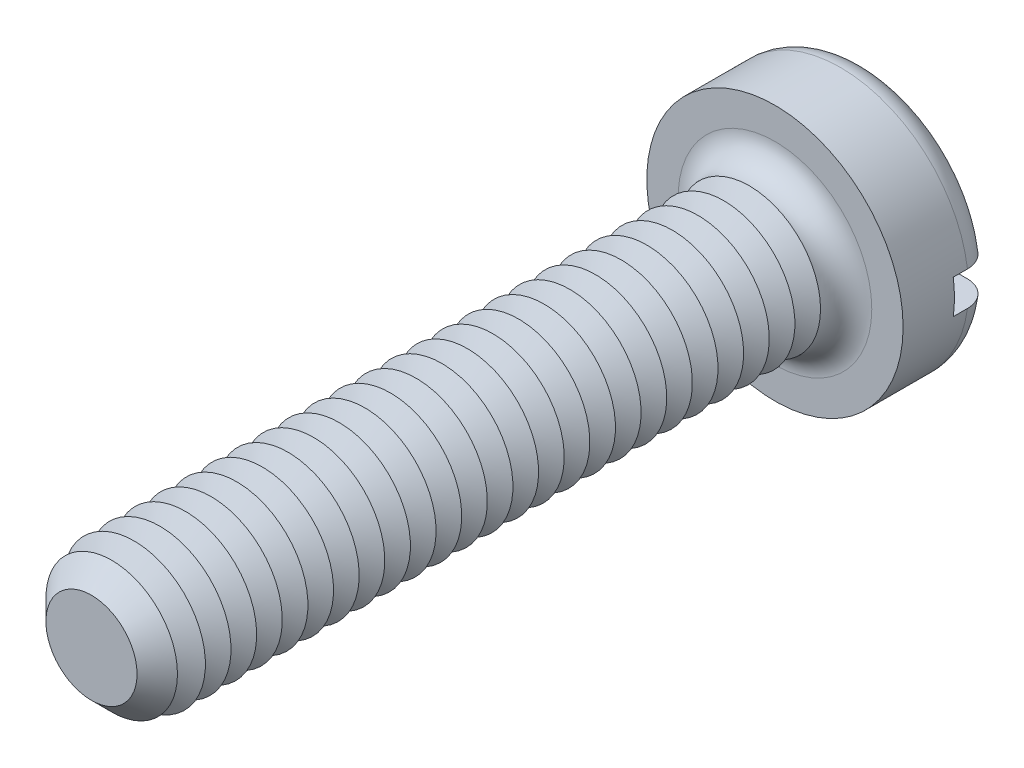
ISO-10303-21;
HEADER;
FILE_DESCRIPTION(('STEP AP214'),'2;1');
FILE_NAME('part.step','',(''),(''),'','','');
FILE_SCHEMA(('AUTOMOTIVE_DESIGN { 1 0 10303 214 1 1 1 1 }'));
ENDSEC;
DATA;
#1=APPLICATION_CONTEXT('core data for automotive mechanical design processes');
#2=APPLICATION_PROTOCOL_DEFINITION('international standard','automotive_design',2000,#1);
#3=PRODUCT_CONTEXT('',#1,'mechanical');
#4=PRODUCT('Part','Part','',(#3));
#5=PRODUCT_RELATED_PRODUCT_CATEGORY('part','',(#4));
#6=PRODUCT_DEFINITION_FORMATION('','',#4);
#7=PRODUCT_DEFINITION_CONTEXT('part definition',#1,'design');
#8=PRODUCT_DEFINITION('design','',#6,#7);
#9=PRODUCT_DEFINITION_SHAPE('','',#8);
#10=(LENGTH_UNIT() NAMED_UNIT(*) SI_UNIT(.MILLI.,.METRE.));
#11=(NAMED_UNIT(*) PLANE_ANGLE_UNIT() SI_UNIT($,.RADIAN.));
#12=(NAMED_UNIT(*) SI_UNIT($,.STERADIAN.) SOLID_ANGLE_UNIT());
#13=UNCERTAINTY_MEASURE_WITH_UNIT(LENGTH_MEASURE(1.E-05),#10,'distance_accuracy_value','');
#14=(GEOMETRIC_REPRESENTATION_CONTEXT(3) GLOBAL_UNCERTAINTY_ASSIGNED_CONTEXT((#13)) GLOBAL_UNIT_ASSIGNED_CONTEXT((#10,
#11,#12)) REPRESENTATION_CONTEXT('',''));
#15=CARTESIAN_POINT('',(0.,0.,0.));
#16=DIRECTION('',(0.,0.,1.));
#17=DIRECTION('',(1.,0.,0.));
#18=AXIS2_PLACEMENT_3D('',#15,#16,#17);
#19=CARTESIAN_POINT('',(0.,0.,-1.6));
#20=DIRECTION('',(0.,0.,1.));
#21=DIRECTION('',(1.,0.,0.));
#22=AXIS2_PLACEMENT_3D('',#19,#20,#21);
#23=PLANE('',#22);
#24=CARTESIAN_POINT('',(0.,0.,-1.6));
#25=DIRECTION('',(0.,0.,1.));
#26=DIRECTION('',(1.,0.,0.));
#27=AXIS2_PLACEMENT_3D('',#24,#25,#26);
#28=CIRCLE('',#27,1.8);
#29=CARTESIAN_POINT('',(-1.77482393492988,0.3,-1.6));
#30=VERTEX_POINT('',#29);
#31=CARTESIAN_POINT('',(1.77482393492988,0.3,-1.6));
#32=VERTEX_POINT('',#31);
#33=EDGE_CURVE('E116',#30,#32,#28,.F.);
#34=ORIENTED_EDGE('',*,*,#33,.T.);
#35=DIRECTION('',(1.,0.,0.));
#36=VECTOR('',#35,1.);
#37=CARTESIAN_POINT('',(-2.25,0.3,-1.6));
#38=LINE('',#37,#36);
#39=EDGE_CURVE('E111',#30,#32,#38,.T.);
#40=ORIENTED_EDGE('',*,*,#39,.F.);
#41=EDGE_LOOP('',(#34,#40));
#42=FACE_BOUND('',#41,.T.);
#43=ADVANCED_FACE('F39',(#42),#23,.F.);
#44=CARTESIAN_POINT('',(0.,0.,-1.15));
#45=DIRECTION('',(0.,0.,1.));
#46=DIRECTION('',(1.,0.,0.));
#47=AXIS2_PLACEMENT_3D('',#44,#45,#46);
#48=TOROIDAL_SURFACE('',#47,1.8,0.45);
#49=CARTESIAN_POINT('',(-2.09367249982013,0.3,-1.4713087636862));
#50=CARTESIAN_POINT('',(-2.07531034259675,0.3,-1.48912990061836));
#51=CARTESIAN_POINT('',(-2.05541605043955,0.3,-1.50540110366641));
#52=CARTESIAN_POINT('',(-2.01315405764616,0.3,-1.53437465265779));
#53=CARTESIAN_POINT('',(-1.99078310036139,0.3,-1.54707221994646));
#54=CARTESIAN_POINT('',(-1.94425163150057,0.3,-1.56853090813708));
#55=CARTESIAN_POINT('',(-1.92009286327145,0.3,-1.57729580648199));
#56=CARTESIAN_POINT('',(-1.8706617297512,0.3,-1.59068015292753));
#57=CARTESIAN_POINT('',(-1.84538964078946,0.3,-1.59530062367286));
#58=CARTESIAN_POINT('',(-1.7942134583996,0.3,-1.60031507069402));
#59=CARTESIAN_POINT('',(-1.76830582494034,0.3,-1.60067291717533));
#60=CARTESIAN_POINT('',(-1.71679040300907,0.3,-1.59707477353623));
#61=CARTESIAN_POINT('',(-1.69118264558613,0.3,-1.59311834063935));
#62=CARTESIAN_POINT('',(-1.64075792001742,0.3,-1.58095464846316));
#63=CARTESIAN_POINT('',(-1.61594989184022,0.3,-1.57271029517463));
#64=CARTESIAN_POINT('',(-1.56806655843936,0.3,-1.55217762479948));
#65=CARTESIAN_POINT('',(-1.54499130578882,0.3,-1.53988918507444));
#66=CARTESIAN_POINT('',(-1.50122413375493,0.3,-1.51158963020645));
#67=CARTESIAN_POINT('',(-1.48053389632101,0.3,-1.49557591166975));
#68=CARTESIAN_POINT('',(-1.44217532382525,0.3,-1.46026359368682));
#69=CARTESIAN_POINT('',(-1.42450683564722,0.3,-1.4409651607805));
#70=CARTESIAN_POINT('',(-1.39293961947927,0.3,-1.39986821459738));
#71=CARTESIAN_POINT('',(-1.37899788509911,0.3,-1.37810275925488));
#72=CARTESIAN_POINT('',(-1.35506190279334,0.3,-1.33249939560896));
#73=CARTESIAN_POINT('',(-1.34506709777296,0.3,-1.30866178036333));
#74=CARTESIAN_POINT('',(-1.3295415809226,0.3,-1.26015137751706));
#75=CARTESIAN_POINT('',(-1.32391771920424,0.3,-1.23550839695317));
#76=CARTESIAN_POINT('',(-1.31696995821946,0.3,-1.18562442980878));
#77=CARTESIAN_POINT('',(-1.31564552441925,0.3,-1.16038351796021));
#78=CARTESIAN_POINT('',(-1.31732714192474,0.3,-1.11049178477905));
#79=CARTESIAN_POINT('',(-1.32025766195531,0.3,-1.08583837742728));
#80=CARTESIAN_POINT('',(-1.3302124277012,0.3,-1.03737369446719));
#81=CARTESIAN_POINT('',(-1.33723664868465,0.3,-1.01356241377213));
#82=CARTESIAN_POINT('',(-1.35515820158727,0.3,-0.967413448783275));
#83=CARTESIAN_POINT('',(-1.36606032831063,0.3,-0.945077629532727));
#84=CARTESIAN_POINT('',(-1.39139351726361,0.3,-0.902507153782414));
#85=CARTESIAN_POINT('',(-1.40582489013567,0.3,-0.882272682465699));
#86=CARTESIAN_POINT('',(-1.43808691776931,0.3,-0.844072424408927));
#87=CARTESIAN_POINT('',(-1.4559757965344,0.3,-0.826155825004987));
#88=CARTESIAN_POINT('',(-1.49445205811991,0.3,-0.793502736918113));
#89=CARTESIAN_POINT('',(-1.51503974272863,0.3,-0.778766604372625));
#90=CARTESIAN_POINT('',(-1.55880475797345,0.3,-0.752571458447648));
#91=CARTESIAN_POINT('',(-1.58202794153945,0.3,-0.741189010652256));
#92=CARTESIAN_POINT('',(-1.63004083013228,0.3,-0.722432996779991));
#93=CARTESIAN_POINT('',(-1.65483064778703,0.3,-0.715059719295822));
#94=CARTESIAN_POINT('',(-1.70558060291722,0.3,-0.704463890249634));
#95=CARTESIAN_POINT('',(-1.73155090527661,0.3,-0.701289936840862));
#96=CARTESIAN_POINT('',(-1.78365633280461,0.3,-0.699350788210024));
#97=CARTESIAN_POINT('',(-1.80979145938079,0.3,-0.700585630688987));
#98=CARTESIAN_POINT('',(-1.86145503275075,0.3,-0.70744393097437));
#99=CARTESIAN_POINT('',(-1.88698403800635,0.3,-0.713063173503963));
#100=CARTESIAN_POINT('',(-1.93672112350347,0.3,-0.728546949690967));
#101=CARTESIAN_POINT('',(-1.96092925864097,0.3,-0.738411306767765));
#102=CARTESIAN_POINT('',(-2.00710191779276,0.3,-0.762015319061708));
#103=CARTESIAN_POINT('',(-2.02908465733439,0.3,-0.775719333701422));
#104=CARTESIAN_POINT('',(-2.0704025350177,0.3,-0.806663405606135));
#105=CARTESIAN_POINT('',(-2.08973782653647,0.3,-0.823903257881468));
#106=CARTESIAN_POINT('',(-2.12497879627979,0.3,-0.861218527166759));
#107=CARTESIAN_POINT('',(-2.1409209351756,0.3,-0.881259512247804));
#108=CARTESIAN_POINT('',(-2.16917502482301,0.3,-0.92375535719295));
#109=CARTESIAN_POINT('',(-2.18148717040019,0.3,-0.946210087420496));
#110=CARTESIAN_POINT('',(-2.20201023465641,0.3,-0.99266079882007));
#111=CARTESIAN_POINT('',(-2.21025973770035,0.3,-1.01663973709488));
#112=CARTESIAN_POINT('',(-2.22258852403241,0.3,-1.06564563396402));
#113=CARTESIAN_POINT('',(-2.22666813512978,0.3,-1.0906725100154));
#114=CARTESIAN_POINT('',(-2.23052418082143,0.3,-1.14090288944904));
#115=CARTESIAN_POINT('',(-2.23032644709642,0.3,-1.16610441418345));
#116=CARTESIAN_POINT('',(-2.22569614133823,0.3,-1.21612212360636));
#117=CARTESIAN_POINT('',(-2.2212625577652,0.3,-1.24093821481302));
#118=CARTESIAN_POINT('',(-2.20829785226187,0.3,-1.2894516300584));
#119=CARTESIAN_POINT('',(-2.19976997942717,0.3,-1.31314982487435));
#120=CARTESIAN_POINT('',(-2.17887390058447,0.3,-1.35876313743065));
#121=CARTESIAN_POINT('',(-2.1665103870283,0.3,-1.3806803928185));
#122=CARTESIAN_POINT('',(-2.14384463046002,0.3,-1.4140108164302));
#123=CARTESIAN_POINT('',(-2.13462949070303,0.3,-1.42617780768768));
#124=CARTESIAN_POINT('',(-2.1150151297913,0.3,-1.44951629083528));
#125=CARTESIAN_POINT('',(-2.10461591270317,0.3,-1.46068778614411));
#126=CARTESIAN_POINT('',(-2.09367249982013,0.3,-1.4713087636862));
#127=B_SPLINE_CURVE_WITH_KNOTS('',3,(#49,#50,#51,#52,#53,#54,#55,#56,#57,#58,#59,#60,#61,#62,
#63,#64,#65,#66,#67,#68,#69,#70,#71,#72,#73,#74,#75,#76,#77,#78,#79,#80,#81,#82,#83,#84,#85,#86,
#87,#88,#89,#90,#91,#92,#93,#94,#95,#96,#97,#98,#99,#100,#101,#102,#103,#104,#105,#106,#107,
#108,#109,#110,#111,#112,#113,#114,#115,#116,#117,#118,#119,#120,#121,#122,#123,#124,#125,#126),
.UNSPECIFIED.,.T.,.F.,(4,2,2,2,2,2,2,2,2,2,2,2,2,2,2,2,2,2,2,2,2,2,2,2,2,2,2,2,2,2,2,2,2,2,2,2,
2,2,4),(0.,0.0767085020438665,0.153519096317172,0.230255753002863,0.306973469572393,
0.384340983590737,0.461716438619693,0.539772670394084,0.617831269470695,0.695944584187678,
0.774053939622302,0.851218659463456,0.928372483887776,1.00383319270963,1.07928451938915,
1.15341274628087,1.22754052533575,1.30176027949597,1.37598656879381,1.45159320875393,
1.52720831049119,1.6044355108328,1.68166826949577,1.75978723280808,1.8379068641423,
1.91595148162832,1.99399285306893,2.07133254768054,2.14866775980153,2.22512456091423,
2.30157725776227,2.3772891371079,2.45299506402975,2.52824391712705,2.60351074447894,
2.67871794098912,2.75383349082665,2.79955010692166,2.84526656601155),.UNSPECIFIED.);
#128=CARTESIAN_POINT('',(-2.22991031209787,0.3,-1.14999999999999));
#129=VERTEX_POINT('',#128);
#130=EDGE_CURVE('E385',#129,#30,#127,.T.);
#131=ORIENTED_EDGE('',*,*,#130,.F.);
#132=CARTESIAN_POINT('',(0.,0.,-1.15));
#133=DIRECTION('',(0.,0.,1.));
#134=DIRECTION('',(1.,0.,0.));
#135=AXIS2_PLACEMENT_3D('',#132,#133,#134);
#136=CIRCLE('',#135,2.25);
#137=CARTESIAN_POINT('',(2.22991031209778,0.3,-1.15));
#138=VERTEX_POINT('',#137);
#139=EDGE_CURVE('E125',#138,#129,#136,.T.);
#140=ORIENTED_EDGE('',*,*,#139,.F.);
#141=CARTESIAN_POINT('',(1.39325818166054,0.3,-1.39903402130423));
#142=CARTESIAN_POINT('',(1.40771723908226,0.3,-1.42030595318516));
#143=CARTESIAN_POINT('',(1.4240122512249,0.3,-1.4403555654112));
#144=CARTESIAN_POINT('',(1.45976320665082,0.3,-1.4774406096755));
#145=CARTESIAN_POINT('',(1.47922380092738,0.3,-1.49447152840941));
#146=CARTESIAN_POINT('',(1.5206923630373,0.3,-1.52502510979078));
#147=CARTESIAN_POINT('',(1.54269721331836,0.3,-1.53855200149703));
#148=CARTESIAN_POINT('',(1.58863815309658,0.3,-1.56176272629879));
#149=CARTESIAN_POINT('',(1.61257369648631,0.3,-1.57144764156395));
#150=CARTESIAN_POINT('',(1.66199169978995,0.3,-1.58680804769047));
#151=CARTESIAN_POINT('',(1.68748839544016,0.3,-1.59243778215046));
#152=CARTESIAN_POINT('',(1.73906656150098,0.3,-1.59934902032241));
#153=CARTESIAN_POINT('',(1.76514807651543,0.3,-1.60063019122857));
#154=CARTESIAN_POINT('',(1.81721740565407,0.3,-1.59879130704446));
#155=CARTESIAN_POINT('',(1.84320486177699,0.3,-1.59566102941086));
#156=CARTESIAN_POINT('',(1.89427635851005,0.3,-1.58504931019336));
#157=CARTESIAN_POINT('',(1.91936042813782,0.3,-1.57756800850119));
#158=CARTESIAN_POINT('',(1.9677137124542,0.3,-1.55851722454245));
#159=CARTESIAN_POINT('',(1.99099484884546,0.3,-1.5469780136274));
#160=CARTESIAN_POINT('',(2.03525897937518,0.3,-1.52011224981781));
#161=CARTESIAN_POINT('',(2.05624211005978,0.3,-1.50478592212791));
#162=CARTESIAN_POINT('',(2.09506403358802,0.3,-1.47096472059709));
#163=CARTESIAN_POINT('',(2.11293536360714,0.3,-1.45250719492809));
#164=CARTESIAN_POINT('',(2.14528563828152,0.3,-1.41282609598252));
#165=CARTESIAN_POINT('',(2.15976477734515,0.3,-1.39160268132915));
#166=CARTESIAN_POINT('',(2.18476262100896,0.3,-1.34723254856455));
#167=CARTESIAN_POINT('',(2.19532119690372,0.3,-1.32410828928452));
#168=CARTESIAN_POINT('',(2.21237438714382,0.3,-1.27640693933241));
#169=CARTESIAN_POINT('',(2.21886918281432,0.3,-1.25182991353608));
#170=CARTESIAN_POINT('',(2.2275687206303,0.3,-1.20210937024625));
#171=CARTESIAN_POINT('',(2.22980376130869,0.3,-1.17697115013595));
#172=CARTESIAN_POINT('',(2.23000940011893,0.3,-1.12667754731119));
#173=CARTESIAN_POINT('',(2.22798009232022,0.3,-1.10152216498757));
#174=CARTESIAN_POINT('',(2.21972856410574,0.3,-1.05197773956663));
#175=CARTESIAN_POINT('',(2.21351744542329,0.3,-1.02758684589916));
#176=CARTESIAN_POINT('',(2.19709696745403,0.3,-0.980190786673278));
#177=CARTESIAN_POINT('',(2.18688760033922,0.3,-0.957185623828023));
#178=CARTESIAN_POINT('',(2.1627435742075,0.3,-0.913157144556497));
#179=CARTESIAN_POINT('',(2.14880093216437,0.3,-0.892138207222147));
#180=CARTESIAN_POINT('',(2.11760640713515,0.3,-0.852719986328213));
#181=CARTESIAN_POINT('',(2.10035443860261,0.3,-0.834320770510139));
#182=CARTESIAN_POINT('',(2.06291254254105,0.3,-0.80052923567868));
#183=CARTESIAN_POINT('',(2.04270386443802,0.3,-0.785157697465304));
#184=CARTESIAN_POINT('',(2.0000139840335,0.3,-0.757986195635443));
#185=CARTESIAN_POINT('',(1.97753267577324,0.3,-0.746186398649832));
#186=CARTESIAN_POINT('',(1.93069507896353,0.3,-0.726364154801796));
#187=CARTESIAN_POINT('',(1.90632219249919,0.3,-0.718380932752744));
#188=CARTESIAN_POINT('',(1.85658993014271,0.3,-0.706569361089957));
#189=CARTESIAN_POINT('',(1.83123049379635,0.3,-0.702741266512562));
#190=CARTESIAN_POINT('',(1.77994107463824,0.3,-0.699306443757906));
#191=CARTESIAN_POINT('',(1.75400788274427,0.3,-0.69974759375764));
#192=CARTESIAN_POINT('',(1.70257608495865,0.3,-0.704939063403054));
#193=CARTESIAN_POINT('',(1.67707750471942,0.3,-0.709689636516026));
#194=CARTESIAN_POINT('',(1.62701662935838,0.3,-0.723419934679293));
#195=CARTESIAN_POINT('',(1.60246387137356,0.3,-0.732434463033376));
#196=CARTESIAN_POINT('',(1.55521886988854,0.3,-0.754458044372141));
#197=CARTESIAN_POINT('',(1.53252668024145,0.3,-0.76746721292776));
#198=CARTESIAN_POINT('',(1.48966925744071,0.3,-0.797124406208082));
#199=CARTESIAN_POINT('',(1.46950315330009,0.3,-0.813771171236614));
#200=CARTESIAN_POINT('',(1.43229728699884,0.3,-0.850255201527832));
#201=CARTESIAN_POINT('',(1.41525734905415,0.3,-0.870092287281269));
#202=CARTESIAN_POINT('',(1.3850470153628,0.3,-0.912123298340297));
#203=CARTESIAN_POINT('',(1.37182821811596,0.3,-0.934282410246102));
#204=CARTESIAN_POINT('',(1.34939737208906,0.3,-0.980542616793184));
#205=CARTESIAN_POINT('',(1.34018456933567,0.3,-1.00464334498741));
#206=CARTESIAN_POINT('',(1.32624172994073,0.3,-1.05352472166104));
#207=CARTESIAN_POINT('',(1.32141599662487,0.3,-1.07827808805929));
#208=CARTESIAN_POINT('',(1.31606478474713,0.3,-1.12825155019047));
#209=CARTESIAN_POINT('',(1.31553992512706,0.3,-1.15347171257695));
#210=CARTESIAN_POINT('',(1.31878307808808,0.3,-1.20323022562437));
#211=CARTESIAN_POINT('',(1.32248353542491,0.3,-1.22777305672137));
#212=CARTESIAN_POINT('',(1.33394086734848,0.3,-1.27586981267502));
#213=CARTESIAN_POINT('',(1.34169274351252,0.3,-1.2994249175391));
#214=CARTESIAN_POINT('',(1.35704250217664,0.3,-1.33561898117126));
#215=CARTESIAN_POINT('',(1.36341395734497,0.3,-1.34879219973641));
#216=CARTESIAN_POINT('',(1.37741190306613,0.3,-1.37445328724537));
#217=CARTESIAN_POINT('',(1.38503837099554,0.3,-1.38694116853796));
#218=CARTESIAN_POINT('',(1.39325818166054,0.3,-1.39903402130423));
#219=B_SPLINE_CURVE_WITH_KNOTS('',3,(#141,#142,#143,#144,#145,#146,#147,#148,#149,#150,#151,
#152,#153,#154,#155,#156,#157,#158,#159,#160,#161,#162,#163,#164,#165,#166,#167,#168,#169,#170,
#171,#172,#173,#174,#175,#176,#177,#178,#179,#180,#181,#182,#183,#184,#185,#186,#187,#188,#189,
#190,#191,#192,#193,#194,#195,#196,#197,#198,#199,#200,#201,#202,#203,#204,#205,#206,#207,#208,
#209,#210,#211,#212,#213,#214,#215,#216,#217,#218),.UNSPECIFIED.,.T.,.F.,(4,2,2,2,2,2,2,2,2,2,2,
2,2,2,2,2,2,2,2,2,2,2,2,2,2,2,2,2,2,2,2,2,2,2,2,2,2,2,4),(0.,0.0771077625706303,
0.154329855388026,0.231458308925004,0.308565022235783,0.386528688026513,0.464498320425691,
0.542648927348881,0.620797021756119,0.698374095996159,0.77594655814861,0.852651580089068,
0.929352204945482,1.00524992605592,1.08114426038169,1.15649673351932,1.2318475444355,
1.30699910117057,1.38215080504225,1.45746451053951,1.53278016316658,1.60859599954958,
1.68441537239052,1.76099806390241,1.83758545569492,1.91503273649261,1.99248457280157,
2.07057979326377,2.14867727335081,2.22674775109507,2.30481383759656,2.38184276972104,
2.45885719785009,2.53414829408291,2.6094502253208,2.68356487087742,2.75758829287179,
2.80142397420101,2.84525886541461),.UNSPECIFIED.);
#220=EDGE_CURVE('E387',#32,#138,#219,.T.);
#221=ORIENTED_EDGE('',*,*,#220,.F.);
#222=ORIENTED_EDGE('',*,*,#33,.F.);
#223=EDGE_LOOP('',(#131,#140,#221,#222));
#224=FACE_BOUND('',#223,.T.);
#225=ADVANCED_FACE('F369',(#224),#48,.T.);
#226=CARTESIAN_POINT('',(0.,0.,-1.6));
#227=DIRECTION('',(0.,0.,1.));
#228=DIRECTION('',(1.,0.,0.));
#229=AXIS2_PLACEMENT_3D('',#226,#227,#228);
#230=CYLINDRICAL_SURFACE('',#229,2.25);
#231=DIRECTION('',(0.,0.,1.));
#232=VECTOR('',#231,1.);
#233=CARTESIAN_POINT('',(2.22991031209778,0.3,-1.6));
#234=LINE('',#233,#232);
#235=CARTESIAN_POINT('',(2.22991031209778,0.3,-0.9));
#236=VERTEX_POINT('',#235);
#237=EDGE_CURVE('E401',#138,#236,#234,.T.);
#238=ORIENTED_EDGE('',*,*,#237,.F.);
#239=ORIENTED_EDGE('',*,*,#139,.T.);
#240=DIRECTION('',(0.,0.,1.));
#241=VECTOR('',#240,1.);
#242=CARTESIAN_POINT('',(-2.22991031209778,0.3,-1.6));
#243=LINE('',#242,#241);
#244=CARTESIAN_POINT('',(-2.22991031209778,0.3,-0.9));
#245=VERTEX_POINT('',#244);
#246=EDGE_CURVE('E63',#245,#129,#243,.F.);
#247=ORIENTED_EDGE('',*,*,#246,.F.);
#248=CARTESIAN_POINT('',(0.,0.,-0.9));
#249=DIRECTION('',(0.,0.,-1.));
#250=DIRECTION('',(-1.,0.,0.));
#251=AXIS2_PLACEMENT_3D('',#248,#249,#250);
#252=CIRCLE('',#251,2.25);
#253=CARTESIAN_POINT('',(-2.22991031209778,-0.3,-0.9));
#254=VERTEX_POINT('',#253);
#255=EDGE_CURVE('E43',#245,#254,#252,.F.);
#256=ORIENTED_EDGE('',*,*,#255,.T.);
#257=DIRECTION('',(0.,0.,1.));
#258=VECTOR('',#257,1.);
#259=CARTESIAN_POINT('',(-2.22991031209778,-0.3,-1.6));
#260=LINE('',#259,#258);
#261=CARTESIAN_POINT('',(-2.22991031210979,-0.3,-1.15000000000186));
#262=VERTEX_POINT('',#261);
#263=EDGE_CURVE('E398',#262,#254,#260,.T.);
#264=ORIENTED_EDGE('',*,*,#263,.F.);
#265=CARTESIAN_POINT('',(2.22991031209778,-0.3,-1.15));
#266=VERTEX_POINT('',#265);
#267=EDGE_CURVE('E127',#262,#266,#136,.T.);
#268=ORIENTED_EDGE('',*,*,#267,.T.);
#269=DIRECTION('',(0.,0.,1.));
#270=VECTOR('',#269,1.);
#271=CARTESIAN_POINT('',(2.22991031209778,-0.3,-1.6));
#272=LINE('',#271,#270);
#273=CARTESIAN_POINT('',(2.22991031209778,-0.3,-0.9));
#274=VERTEX_POINT('',#273);
#275=EDGE_CURVE('E55',#274,#266,#272,.F.);
#276=ORIENTED_EDGE('',*,*,#275,.F.);
#277=EDGE_CURVE('E11',#274,#236,#252,.F.);
#278=ORIENTED_EDGE('',*,*,#277,.T.);
#279=EDGE_LOOP('',(#238,#239,#247,#256,#264,#268,#276,#278));
#280=FACE_BOUND('',#279,.T.);
#281=CARTESIAN_POINT('',(0.,0.,0.));
#282=DIRECTION('',(0.,0.,1.));
#283=DIRECTION('',(1.,0.,0.));
#284=AXIS2_PLACEMENT_3D('',#281,#282,#283);
#285=CIRCLE('',#284,2.25);
#286=CARTESIAN_POINT('',(2.25,0.,0.));
#287=VERTEX_POINT('',#286);
#288=EDGE_CURVE('E404',#287,#287,#285,.T.);
#289=ORIENTED_EDGE('',*,*,#288,.F.);
#290=EDGE_LOOP('',(#289));
#291=FACE_BOUND('',#290,.T.);
#292=ADVANCED_FACE('F365',(#280,#291),#230,.T.);
#293=CARTESIAN_POINT('',(1.77482393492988,-0.3,-1.6));
#294=VERTEX_POINT('',#293);
#295=CARTESIAN_POINT('',(-1.77482393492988,-0.3,-1.6));
#296=VERTEX_POINT('',#295);
#297=EDGE_CURVE('E109',#294,#296,#28,.F.);
#298=ORIENTED_EDGE('',*,*,#297,.T.);
#299=DIRECTION('',(-1.,0.,0.));
#300=VECTOR('',#299,1.);
#301=CARTESIAN_POINT('',(-2.25,-0.3,-1.6));
#302=LINE('',#301,#300);
#303=EDGE_CURVE('E96',#294,#296,#302,.T.);
#304=ORIENTED_EDGE('',*,*,#303,.F.);
#305=EDGE_LOOP('',(#298,#304));
#306=FACE_BOUND('',#305,.T.);
#307=ADVANCED_FACE('F108',(#306),#23,.F.);
#308=CARTESIAN_POINT('',(0.,0.,0.));
#309=DIRECTION('',(0.,0.,1.));
#310=DIRECTION('',(1.,0.,0.));
#311=AXIS2_PLACEMENT_3D('',#308,#309,#310);
#312=PLANE('',#311);
#313=CARTESIAN_POINT('',(0.,0.,0.));
#314=DIRECTION('',(0.,0.,1.));
#315=DIRECTION('',(1.,0.,0.));
#316=AXIS2_PLACEMENT_3D('',#313,#314,#315);
#317=CIRCLE('',#316,1.7);
#318=CARTESIAN_POINT('',(1.7,0.,0.));
#319=VERTEX_POINT('',#318);
#320=EDGE_CURVE('E115',#319,#319,#317,.F.);
#321=ORIENTED_EDGE('',*,*,#320,.T.);
#322=EDGE_LOOP('',(#321));
#323=FACE_BOUND('',#322,.T.);
#324=ORIENTED_EDGE('',*,*,#288,.T.);
#325=EDGE_LOOP('',(#324));
#326=FACE_BOUND('',#325,.T.);
#327=ADVANCED_FACE('F364',(#323,#326),#312,.T.);
#328=CARTESIAN_POINT('',(-2.09367249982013,-0.3,-1.4713087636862));
#329=CARTESIAN_POINT('',(-2.11176539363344,-0.3,-1.45374579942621));
#330=CARTESIAN_POINT('',(-2.1283968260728,-0.3,-1.43465254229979));
#331=CARTESIAN_POINT('',(-2.15823692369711,-0.3,-1.39393307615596));
#332=CARTESIAN_POINT('',(-2.17144184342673,-0.3,-1.37230413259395));
#333=CARTESIAN_POINT('',(-2.19402281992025,-0.3,-1.32713362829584));
#334=CARTESIAN_POINT('',(-2.20339951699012,-0.3,-1.30359238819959));
#335=CARTESIAN_POINT('',(-2.21804409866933,-0.3,-1.25527081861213));
#336=CARTESIAN_POINT('',(-2.22331295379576,-0.3,-1.23049078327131));
#337=CARTESIAN_POINT('',(-2.22957448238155,-0.3,-1.18050893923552));
#338=CARTESIAN_POINT('',(-2.23058617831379,-0.3,-1.15530951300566));
#339=CARTESIAN_POINT('',(-2.22835535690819,-0.3,-1.10509920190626));
#340=CARTESIAN_POINT('',(-2.22511277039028,-0.3,-1.08008832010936));
#341=CARTESIAN_POINT('',(-2.21448018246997,-0.3,-1.03101646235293));
#342=CARTESIAN_POINT('',(-2.20709836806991,-0.3,-1.00695371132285));
#343=CARTESIAN_POINT('',(-2.18841075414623,-0.3,-0.960404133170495));
#344=CARTESIAN_POINT('',(-2.17710493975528,-0.3,-0.937917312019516));
#345=CARTESIAN_POINT('',(-2.15086234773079,-0.3,-0.895085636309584));
#346=CARTESIAN_POINT('',(-2.13591537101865,-0.3,-0.874747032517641));
#347=CARTESIAN_POINT('',(-2.1028415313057,-0.3,-0.836845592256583));
#348=CARTESIAN_POINT('',(-2.08471458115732,-0.3,-0.819282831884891));
#349=CARTESIAN_POINT('',(-2.0456590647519,-0.3,-0.78729174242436));
#350=CARTESIAN_POINT('',(-2.0247112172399,-0.3,-0.772886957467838));
#351=CARTESIAN_POINT('',(-1.98071452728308,-0.3,-0.747756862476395));
#352=CARTESIAN_POINT('',(-1.95766557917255,-0.3,-0.737031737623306));
#353=CARTESIAN_POINT('',(-1.90986554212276,-0.3,-0.71944451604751));
#354=CARTESIAN_POINT('',(-1.88509923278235,-0.3,-0.712623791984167));
#355=CARTESIAN_POINT('',(-1.83477837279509,-0.3,-0.703186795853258));
#356=CARTESIAN_POINT('',(-1.80922377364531,-0.3,-0.700570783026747));
#357=CARTESIAN_POINT('',(-1.75774893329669,-0.3,-0.699591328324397));
#358=CARTESIAN_POINT('',(-1.73182778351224,-0.3,-0.701275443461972));
#359=CARTESIAN_POINT('',(-1.68062744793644,-0.3,-0.708937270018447));
#360=CARTESIAN_POINT('',(-1.65534829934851,-0.3,-0.714915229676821));
#361=CARTESIAN_POINT('',(-1.6059539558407,-0.3,-0.731056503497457));
#362=CARTESIAN_POINT('',(-1.58184881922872,-0.3,-0.741250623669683));
#363=CARTESIAN_POINT('',(-1.53569497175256,-0.3,-0.765548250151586));
#364=CARTESIAN_POINT('',(-1.51364629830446,-0.3,-0.779651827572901));
#365=CARTESIAN_POINT('',(-1.47229470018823,-0.3,-0.811355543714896));
#366=CARTESIAN_POINT('',(-1.45298625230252,-0.3,-0.828948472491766));
#367=CARTESIAN_POINT('',(-1.41765142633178,-0.3,-0.867170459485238));
#368=CARTESIAN_POINT('',(-1.40162480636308,-0.3,-0.887799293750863));
#369=CARTESIAN_POINT('',(-1.37358365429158,-0.3,-0.93118317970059));
#370=CARTESIAN_POINT('',(-1.3615121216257,-0.3,-0.953901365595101));
#371=CARTESIAN_POINT('',(-1.34145576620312,-0.3,-1.00107529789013));
#372=CARTESIAN_POINT('',(-1.33347032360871,-0.3,-1.02553078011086));
#373=CARTESIAN_POINT('',(-1.32199536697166,-0.3,-1.07489401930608));
#374=CARTESIAN_POINT('',(-1.31840873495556,-0.3,-1.09977921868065));
#375=CARTESIAN_POINT('',(-1.31553052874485,-0.3,-1.1497957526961));
#376=CARTESIAN_POINT('',(-1.31623852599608,-0.3,-1.17492706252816));
#377=CARTESIAN_POINT('',(-1.32188368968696,-0.3,-1.22435119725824));
#378=CARTESIAN_POINT('',(-1.32676151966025,-0.3,-1.24865083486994));
#379=CARTESIAN_POINT('',(-1.34050334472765,-0.3,-1.29609421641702));
#380=CARTESIAN_POINT('',(-1.34936742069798,-0.3,-1.31923793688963));
#381=CARTESIAN_POINT('',(-1.37086295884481,-0.3,-1.36387796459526));
#382=CARTESIAN_POINT('',(-1.38351729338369,-0.3,-1.38536324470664));
#383=CARTESIAN_POINT('',(-1.41218367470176,-0.3,-1.42596199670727));
#384=CARTESIAN_POINT('',(-1.42819606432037,-0.3,-1.44507522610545));
#385=CARTESIAN_POINT('',(-1.46347664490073,-0.3,-1.48081087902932));
#386=CARTESIAN_POINT('',(-1.48280543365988,-0.3,-1.49737347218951));
#387=CARTESIAN_POINT('',(-1.5239232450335,-0.3,-1.52709508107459));
#388=CARTESIAN_POINT('',(-1.54571253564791,-0.3,-1.54025372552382));
#389=CARTESIAN_POINT('',(-1.59160097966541,-0.3,-1.56305446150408));
#390=CARTESIAN_POINT('',(-1.61573734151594,-0.3,-1.57262172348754));
#391=CARTESIAN_POINT('',(-1.66526504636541,-0.3,-1.58760700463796));
#392=CARTESIAN_POINT('',(-1.69065641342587,-0.3,-1.59302494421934));
#393=CARTESIAN_POINT('',(-1.74220154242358,-0.3,-1.59958446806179));
#394=CARTESIAN_POINT('',(-1.7683598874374,-0.3,-1.60069012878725));
#395=CARTESIAN_POINT('',(-1.82049681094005,-0.3,-1.59847888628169));
#396=CARTESIAN_POINT('',(-1.8464753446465,-0.3,-1.59516091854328));
#397=CARTESIAN_POINT('',(-1.89742078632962,-0.3,-1.58419269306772));
#398=CARTESIAN_POINT('',(-1.92239041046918,-0.3,-1.57655503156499));
#399=CARTESIAN_POINT('',(-1.97064988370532,-0.3,-1.55715679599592));
#400=CARTESIAN_POINT('',(-1.99394179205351,-0.3,-1.54540138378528));
#401=CARTESIAN_POINT('',(-2.03003215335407,-0.3,-1.52312594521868));
#402=CARTESIAN_POINT('',(-2.04354254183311,-0.3,-1.51373809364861));
#403=CARTESIAN_POINT('',(-2.06946640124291,-0.3,-1.49355310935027));
#404=CARTESIAN_POINT('',(-2.08187987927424,-0.3,-1.48275598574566));
#405=CARTESIAN_POINT('',(-2.09367249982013,-0.3,-1.4713087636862));
#406=B_SPLINE_CURVE_WITH_KNOTS('',3,(#328,#329,#330,#331,#332,#333,#334,#335,#336,#337,#338,
#339,#340,#341,#342,#343,#344,#345,#346,#347,#348,#349,#350,#351,#352,#353,#354,#355,#356,#357,
#358,#359,#360,#361,#362,#363,#364,#365,#366,#367,#368,#369,#370,#371,#372,#373,#374,#375,#376,
#377,#378,#379,#380,#381,#382,#383,#384,#385,#386,#387,#388,#389,#390,#391,#392,#393,#394,#395,
#396,#397,#398,#399,#400,#401,#402,#403,#404,#405),.UNSPECIFIED.,.T.,.F.,(4,2,2,2,2,2,2,2,2,2,2,
2,2,2,2,2,2,2,2,2,2,2,2,2,2,2,2,2,2,2,2,2,2,2,2,2,2,2,4),(0.,0.0755864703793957,
0.151255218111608,0.226911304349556,0.302549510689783,0.377849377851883,0.453150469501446,
0.528303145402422,0.603456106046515,0.67882204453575,0.754190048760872,0.83010216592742,
0.906018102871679,0.982724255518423,1.05943513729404,1.13699806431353,1.21456547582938,
1.29270994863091,1.37085584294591,1.44884191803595,1.52682224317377,1.60362346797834,
1.68041303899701,1.75547480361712,1.83052907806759,1.90453278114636,1.97853798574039,
2.05299909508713,2.12746781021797,2.20347986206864,2.27950020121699,2.3570265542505,
2.43455439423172,2.5127267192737,2.59091785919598,2.66888216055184,2.74674907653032,
2.79601528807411,2.84528118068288),.UNSPECIFIED.);
#407=EDGE_CURVE('E103',#296,#262,#406,.T.);
#408=ORIENTED_EDGE('',*,*,#407,.F.);
#409=ORIENTED_EDGE('',*,*,#297,.F.);
#410=CARTESIAN_POINT('',(1.39325818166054,-0.3,-1.39903402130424));
#411=CARTESIAN_POINT('',(1.37924349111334,-0.3,-1.37841200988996));
#412=CARTESIAN_POINT('',(1.36693374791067,-0.3,-1.35661225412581));
#413=CARTESIAN_POINT('',(1.34612289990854,-0.3,-1.31124547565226));
#414=CARTESIAN_POINT('',(1.33762533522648,-0.3,-1.28767683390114));
#415=CARTESIAN_POINT('',(1.32472877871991,-0.3,-1.23943261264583));
#416=CARTESIAN_POINT('',(1.3203309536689,-0.3,-1.21475672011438));
#417=CARTESIAN_POINT('',(1.31579198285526,-0.3,-1.16502199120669));
#418=CARTESIAN_POINT('',(1.31564980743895,-0.3,-1.13996324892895));
#419=CARTESIAN_POINT('',(1.31960322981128,-0.3,-1.09044336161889));
#420=CARTESIAN_POINT('',(1.32365524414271,-0.3,-1.06597872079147));
#421=CARTESIAN_POINT('',(1.33579339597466,-0.3,-1.01807218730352));
#422=CARTESIAN_POINT('',(1.34387971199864,-0.3,-0.994630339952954));
#423=CARTESIAN_POINT('',(1.36386460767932,-0.3,-0.949319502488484));
#424=CARTESIAN_POINT('',(1.37577869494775,-0.3,-0.92745736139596));
#425=CARTESIAN_POINT('',(1.40303929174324,-0.3,-0.885990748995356));
#426=CARTESIAN_POINT('',(1.41838612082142,-0.3,-0.866386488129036));
#427=CARTESIAN_POINT('',(1.45239955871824,-0.3,-0.829572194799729));
#428=CARTESIAN_POINT('',(1.47112624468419,-0.3,-0.812417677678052));
#429=CARTESIAN_POINT('',(1.51114353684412,-0.3,-0.78141873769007));
#430=CARTESIAN_POINT('',(1.53243442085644,-0.3,-0.767574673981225));
#431=CARTESIAN_POINT('',(1.57744959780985,-0.3,-0.743302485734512));
#432=CARTESIAN_POINT('',(1.6012148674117,-0.3,-0.732950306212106));
#433=CARTESIAN_POINT('',(1.65013556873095,-0.3,-0.71633816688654));
#434=CARTESIAN_POINT('',(1.67529109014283,-0.3,-0.710078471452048));
#435=CARTESIAN_POINT('',(1.72654223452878,-0.3,-0.701786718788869));
#436=CARTESIAN_POINT('',(1.75264462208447,-0.3,-0.699796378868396));
#437=CARTESIAN_POINT('',(1.80481283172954,-0.3,-0.700236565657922));
#438=CARTESIAN_POINT('',(1.83087865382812,-0.3,-0.702667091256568));
#439=CARTESIAN_POINT('',(1.88216421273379,-0.3,-0.71188843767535));
#440=CARTESIAN_POINT('',(1.90738581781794,-0.3,-0.718668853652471));
#441=CARTESIAN_POINT('',(1.95631449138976,-0.3,-0.736408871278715));
#442=CARTESIAN_POINT('',(1.98002162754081,-0.3,-0.747368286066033));
#443=CARTESIAN_POINT('',(2.02500221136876,-0.3,-0.773046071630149));
#444=CARTESIAN_POINT('',(2.04629687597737,-0.3,-0.78772726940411));
#445=CARTESIAN_POINT('',(2.08608258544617,-0.3,-0.820494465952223));
#446=CARTESIAN_POINT('',(2.10457379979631,-0.3,-0.838580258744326));
#447=CARTESIAN_POINT('',(2.1380062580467,-0.3,-0.877422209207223));
#448=CARTESIAN_POINT('',(2.15298532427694,-0.3,-0.898145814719));
#449=CARTESIAN_POINT('',(2.17921311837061,-0.3,-0.941832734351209));
#450=CARTESIAN_POINT('',(2.19046204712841,-0.3,-0.964795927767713));
#451=CARTESIAN_POINT('',(2.20880507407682,-0.3,-1.01207981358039));
#452=CARTESIAN_POINT('',(2.2159367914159,-0.3,-1.0363859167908));
#453=CARTESIAN_POINT('',(2.22599386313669,-0.3,-1.08585317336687));
#454=CARTESIAN_POINT('',(2.22891936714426,-0.3,-1.11101429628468));
#455=CARTESIAN_POINT('',(2.23047255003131,-0.3,-1.16133395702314));
#456=CARTESIAN_POINT('',(2.22912306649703,-0.3,-1.18649179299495));
#457=CARTESIAN_POINT('',(2.22221641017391,-0.3,-1.236222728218));
#458=CARTESIAN_POINT('',(2.21665928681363,-0.3,-1.26079583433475));
#459=CARTESIAN_POINT('',(2.20150655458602,-0.3,-1.30864604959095));
#460=CARTESIAN_POINT('',(2.19191347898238,-0.3,-1.3319239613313));
#461=CARTESIAN_POINT('',(2.16897085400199,-0.3,-1.37654778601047));
#462=CARTESIAN_POINT('',(2.15562126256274,-0.3,-1.39789367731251));
#463=CARTESIAN_POINT('',(2.12549147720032,-0.3,-1.43814583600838));
#464=CARTESIAN_POINT('',(2.1086973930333,-0.3,-1.45704170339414));
#465=CARTESIAN_POINT('',(2.07219852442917,-0.3,-1.491773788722));
#466=CARTESIAN_POINT('',(2.0524936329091,-0.3,-1.50760989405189));
#467=CARTESIAN_POINT('',(2.01056127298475,-0.3,-1.53591667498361));
#468=CARTESIAN_POINT('',(1.98831430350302,-0.3,-1.54835845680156));
#469=CARTESIAN_POINT('',(1.94206418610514,-0.3,-1.5693763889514));
#470=CARTESIAN_POINT('',(1.91806093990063,-0.3,-1.57795232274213));
#471=CARTESIAN_POINT('',(1.86869953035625,-0.3,-1.5910955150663));
#472=CARTESIAN_POINT('',(1.84332941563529,-0.3,-1.59561788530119));
#473=CARTESIAN_POINT('',(1.7921914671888,-0.3,-1.60038767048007));
#474=CARTESIAN_POINT('',(1.76642362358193,-0.3,-1.60063497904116));
#475=CARTESIAN_POINT('',(1.71493241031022,-0.3,-1.59684388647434));
#476=CARTESIAN_POINT('',(1.6892123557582,-0.3,-1.59276040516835));
#477=CARTESIAN_POINT('',(1.63880694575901,-0.3,-1.58035661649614));
#478=CARTESIAN_POINT('',(1.61412189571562,-0.3,-1.5720350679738));
#479=CARTESIAN_POINT('',(1.56635013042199,-0.3,-1.55132424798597));
#480=CARTESIAN_POINT('',(1.54327365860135,-0.3,-1.53891136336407));
#481=CARTESIAN_POINT('',(1.49956705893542,-0.3,-1.51037484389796));
#482=CARTESIAN_POINT('',(1.478934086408,-0.3,-1.49425558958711));
#483=CARTESIAN_POINT('',(1.44732882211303,-0.3,-1.46489751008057));
#484=CARTESIAN_POINT('',(1.43548118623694,-0.3,-1.45258668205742));
#485=CARTESIAN_POINT('',(1.41324217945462,-0.3,-1.42671249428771));
#486=CARTESIAN_POINT('',(1.40285079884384,-0.3,-1.41314914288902));
#487=CARTESIAN_POINT('',(1.39325818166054,-0.3,-1.39903402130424));
#488=B_SPLINE_CURVE_WITH_KNOTS('',3,(#410,#411,#412,#413,#414,#415,#416,#417,#418,#419,#420,
#421,#422,#423,#424,#425,#426,#427,#428,#429,#430,#431,#432,#433,#434,#435,#436,#437,#438,#439,
#440,#441,#442,#443,#444,#445,#446,#447,#448,#449,#450,#451,#452,#453,#454,#455,#456,#457,#458,
#459,#460,#461,#462,#463,#464,#465,#466,#467,#468,#469,#470,#471,#472,#473,#474,#475,#476,#477,
#478,#479,#480,#481,#482,#483,#484,#485,#486,#487),.UNSPECIFIED.,.T.,.F.,(4,2,2,2,2,2,2,2,2,2,2,
2,2,2,2,2,2,2,2,2,2,2,2,2,2,2,2,2,2,2,2,2,2,2,2,2,2,2,4),(0.,0.0747398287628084,
0.149548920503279,0.224379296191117,0.29919156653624,0.373234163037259,0.447280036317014,
0.521629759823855,0.595986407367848,0.671825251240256,0.747672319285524,0.825076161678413,
0.902485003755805,0.980646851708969,1.05880868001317,1.13678424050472,1.21475631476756,
1.29197834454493,1.36919570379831,1.44553881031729,1.52187780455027,1.59750777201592,
1.67313504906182,1.74835899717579,1.82358206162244,1.89875798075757,1.97393474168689,
2.04942084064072,2.12490971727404,2.20102244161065,2.27713942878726,2.35408926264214,
2.43104101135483,2.50880170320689,2.58658518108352,2.66482568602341,2.74297419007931,
2.79413160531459,2.84528867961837),.UNSPECIFIED.);
#489=EDGE_CURVE('E92',#266,#294,#488,.T.);
#490=ORIENTED_EDGE('',*,*,#489,.F.);
#491=ORIENTED_EDGE('',*,*,#267,.F.);
#492=EDGE_LOOP('',(#408,#409,#490,#491));
#493=FACE_BOUND('',#492,.T.);
#494=ADVANCED_FACE('F113',(#493),#48,.T.);
#495=CARTESIAN_POINT('',(0.,0.,0.450000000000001));
#496=DIRECTION('',(0.,0.,1.));
#497=DIRECTION('',(1.,0.,0.));
#498=AXIS2_PLACEMENT_3D('',#495,#496,#497);
#499=TOROIDAL_SURFACE('',#498,1.7,0.45);
#500=ORIENTED_EDGE('',*,*,#320,.F.);
#501=EDGE_LOOP('',(#500));
#502=FACE_BOUND('',#501,.T.);
#503=CARTESIAN_POINT('',(0.,0.,0.450000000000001));
#504=DIRECTION('',(0.,0.,-1.));
#505=DIRECTION('',(-1.,0.,0.));
#506=AXIS2_PLACEMENT_3D('',#503,#504,#505);
#507=CIRCLE('',#506,1.25);
#508=CARTESIAN_POINT('',(-1.25,0.,0.450000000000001));
#509=VERTEX_POINT('',#508);
#510=EDGE_CURVE('E410',#509,#509,#507,.T.);
#511=ORIENTED_EDGE('',*,*,#510,.T.);
#512=EDGE_LOOP('',(#511));
#513=FACE_BOUND('',#512,.T.);
#514=ADVANCED_FACE('F357',(#502,#513),#499,.F.);
#515=CARTESIAN_POINT('',(0.,0.,0.675000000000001));
#516=DIRECTION('',(0.,0.,-1.));
#517=DIRECTION('',(-1.,0.,0.));
#518=AXIS2_PLACEMENT_3D('',#515,#516,#517);
#519=CONICAL_SURFACE('',#518,0.860288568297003,1.0471975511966);
#520=ORIENTED_EDGE('',*,*,#510,.F.);
#521=EDGE_LOOP('',(#520));
#522=FACE_BOUND('',#521,.T.);
#523=CARTESIAN_POINT('',(0.,0.,0.675000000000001));
#524=DIRECTION('',(0.,0.,-1.));
#525=DIRECTION('',(-1.,0.,0.));
#526=AXIS2_PLACEMENT_3D('',#523,#524,#525);
#527=CIRCLE('',#526,0.860288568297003);
#528=CARTESIAN_POINT('',(-0.860288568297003,0.,0.675000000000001));
#529=VERTEX_POINT('',#528);
#530=EDGE_CURVE('E417',#529,#529,#527,.T.);
#531=ORIENTED_EDGE('',*,*,#530,.T.);
#532=EDGE_LOOP('',(#531));
#533=FACE_BOUND('',#532,.T.);
#534=ADVANCED_FACE('F353',(#522,#533),#519,.T.);
#535=CARTESIAN_POINT('',(0.,0.,0.900000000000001));
#536=DIRECTION('',(0.,0.,1.));
#537=DIRECTION('',(1.,0.,0.));
#538=AXIS2_PLACEMENT_3D('',#535,#536,#537);
#539=CONICAL_SURFACE('',#538,1.25,1.0471975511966);
#540=ORIENTED_EDGE('',*,*,#530,.F.);
#541=EDGE_LOOP('',(#540));
#542=FACE_BOUND('',#541,.T.);
#543=CARTESIAN_POINT('',(0.,0.,0.900000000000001));
#544=DIRECTION('',(0.,0.,-1.));
#545=DIRECTION('',(-1.,0.,0.));
#546=AXIS2_PLACEMENT_3D('',#543,#544,#545);
#547=CIRCLE('',#546,1.25);
#548=CARTESIAN_POINT('',(-1.25,0.,0.900000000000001));
#549=VERTEX_POINT('',#548);
#550=EDGE_CURVE('E423',#549,#549,#547,.T.);
#551=ORIENTED_EDGE('',*,*,#550,.T.);
#552=EDGE_LOOP('',(#551));
#553=FACE_BOUND('',#552,.T.);
#554=ADVANCED_FACE('F349',(#542,#553),#539,.T.);
#555=CARTESIAN_POINT('',(0.,0.,1.125));
#556=DIRECTION('',(0.,0.,-1.));
#557=DIRECTION('',(-1.,0.,0.));
#558=AXIS2_PLACEMENT_3D('',#555,#556,#557);
#559=CONICAL_SURFACE('',#558,0.860288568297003,1.0471975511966);
#560=ORIENTED_EDGE('',*,*,#550,.F.);
#561=EDGE_LOOP('',(#560));
#562=FACE_BOUND('',#561,.T.);
#563=CARTESIAN_POINT('',(0.,0.,1.125));
#564=DIRECTION('',(0.,0.,-1.));
#565=DIRECTION('',(-1.,0.,0.));
#566=AXIS2_PLACEMENT_3D('',#563,#564,#565);
#567=CIRCLE('',#566,0.860288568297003);
#568=CARTESIAN_POINT('',(-0.860288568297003,0.,1.125));
#569=VERTEX_POINT('',#568);
#570=EDGE_CURVE('E427',#569,#569,#567,.T.);
#571=ORIENTED_EDGE('',*,*,#570,.T.);
#572=EDGE_LOOP('',(#571));
#573=FACE_BOUND('',#572,.T.);
#574=ADVANCED_FACE('F345',(#562,#573),#559,.T.);
#575=CARTESIAN_POINT('',(0.,0.,1.35));
#576=DIRECTION('',(0.,0.,1.));
#577=DIRECTION('',(1.,0.,0.));
#578=AXIS2_PLACEMENT_3D('',#575,#576,#577);
#579=CONICAL_SURFACE('',#578,1.25,1.0471975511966);
#580=ORIENTED_EDGE('',*,*,#570,.F.);
#581=EDGE_LOOP('',(#580));
#582=FACE_BOUND('',#581,.T.);
#583=CARTESIAN_POINT('',(0.,0.,1.35));
#584=DIRECTION('',(0.,0.,-1.));
#585=DIRECTION('',(-1.,0.,0.));
#586=AXIS2_PLACEMENT_3D('',#583,#584,#585);
#587=CIRCLE('',#586,1.25);
#588=CARTESIAN_POINT('',(-1.25,0.,1.35));
#589=VERTEX_POINT('',#588);
#590=EDGE_CURVE('E431',#589,#589,#587,.T.);
#591=ORIENTED_EDGE('',*,*,#590,.T.);
#592=EDGE_LOOP('',(#591));
#593=FACE_BOUND('',#592,.T.);
#594=ADVANCED_FACE('F341',(#582,#593),#579,.T.);
#595=CARTESIAN_POINT('',(0.,0.,1.575));
#596=DIRECTION('',(0.,0.,-1.));
#597=DIRECTION('',(-1.,0.,0.));
#598=AXIS2_PLACEMENT_3D('',#595,#596,#597);
#599=CONICAL_SURFACE('',#598,0.860288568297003,1.0471975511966);
#600=ORIENTED_EDGE('',*,*,#590,.F.);
#601=EDGE_LOOP('',(#600));
#602=FACE_BOUND('',#601,.T.);
#603=CARTESIAN_POINT('',(0.,0.,1.575));
#604=DIRECTION('',(0.,0.,-1.));
#605=DIRECTION('',(-1.,0.,0.));
#606=AXIS2_PLACEMENT_3D('',#603,#604,#605);
#607=CIRCLE('',#606,0.860288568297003);
#608=CARTESIAN_POINT('',(-0.860288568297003,0.,1.575));
#609=VERTEX_POINT('',#608);
#610=EDGE_CURVE('E434',#609,#609,#607,.T.);
#611=ORIENTED_EDGE('',*,*,#610,.T.);
#612=EDGE_LOOP('',(#611));
#613=FACE_BOUND('',#612,.T.);
#614=ADVANCED_FACE('F337',(#602,#613),#599,.T.);
#615=CARTESIAN_POINT('',(0.,0.,1.8));
#616=DIRECTION('',(0.,0.,1.));
#617=DIRECTION('',(1.,0.,0.));
#618=AXIS2_PLACEMENT_3D('',#615,#616,#617);
#619=CONICAL_SURFACE('',#618,1.25,1.0471975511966);
#620=ORIENTED_EDGE('',*,*,#610,.F.);
#621=EDGE_LOOP('',(#620));
#622=FACE_BOUND('',#621,.T.);
#623=CARTESIAN_POINT('',(0.,0.,1.8));
#624=DIRECTION('',(0.,0.,-1.));
#625=DIRECTION('',(-1.,0.,0.));
#626=AXIS2_PLACEMENT_3D('',#623,#624,#625);
#627=CIRCLE('',#626,1.25);
#628=CARTESIAN_POINT('',(-1.25,0.,1.8));
#629=VERTEX_POINT('',#628);
#630=EDGE_CURVE('E437',#629,#629,#627,.T.);
#631=ORIENTED_EDGE('',*,*,#630,.T.);
#632=EDGE_LOOP('',(#631));
#633=FACE_BOUND('',#632,.T.);
#634=ADVANCED_FACE('F333',(#622,#633),#619,.T.);
#635=CARTESIAN_POINT('',(0.,0.,2.025));
#636=DIRECTION('',(0.,0.,-1.));
#637=DIRECTION('',(-1.,0.,0.));
#638=AXIS2_PLACEMENT_3D('',#635,#636,#637);
#639=CONICAL_SURFACE('',#638,0.860288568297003,1.0471975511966);
#640=ORIENTED_EDGE('',*,*,#630,.F.);
#641=EDGE_LOOP('',(#640));
#642=FACE_BOUND('',#641,.T.);
#643=CARTESIAN_POINT('',(0.,0.,2.025));
#644=DIRECTION('',(0.,0.,-1.));
#645=DIRECTION('',(-1.,0.,0.));
#646=AXIS2_PLACEMENT_3D('',#643,#644,#645);
#647=CIRCLE('',#646,0.860288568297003);
#648=CARTESIAN_POINT('',(-0.860288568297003,0.,2.025));
#649=VERTEX_POINT('',#648);
#650=EDGE_CURVE('E441',#649,#649,#647,.T.);
#651=ORIENTED_EDGE('',*,*,#650,.T.);
#652=EDGE_LOOP('',(#651));
#653=FACE_BOUND('',#652,.T.);
#654=ADVANCED_FACE('F329',(#642,#653),#639,.T.);
#655=CARTESIAN_POINT('',(0.,0.,2.25));
#656=DIRECTION('',(0.,0.,1.));
#657=DIRECTION('',(1.,0.,0.));
#658=AXIS2_PLACEMENT_3D('',#655,#656,#657);
#659=CONICAL_SURFACE('',#658,1.25,1.0471975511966);
#660=ORIENTED_EDGE('',*,*,#650,.F.);
#661=EDGE_LOOP('',(#660));
#662=FACE_BOUND('',#661,.T.);
#663=CARTESIAN_POINT('',(0.,0.,2.25));
#664=DIRECTION('',(0.,0.,-1.));
#665=DIRECTION('',(-1.,0.,0.));
#666=AXIS2_PLACEMENT_3D('',#663,#664,#665);
#667=CIRCLE('',#666,1.25);
#668=CARTESIAN_POINT('',(-1.25,0.,2.25));
#669=VERTEX_POINT('',#668);
#670=EDGE_CURVE('E445',#669,#669,#667,.T.);
#671=ORIENTED_EDGE('',*,*,#670,.T.);
#672=EDGE_LOOP('',(#671));
#673=FACE_BOUND('',#672,.T.);
#674=ADVANCED_FACE('F325',(#662,#673),#659,.T.);
#675=CARTESIAN_POINT('',(0.,0.,2.475));
#676=DIRECTION('',(0.,0.,-1.));
#677=DIRECTION('',(-1.,0.,0.));
#678=AXIS2_PLACEMENT_3D('',#675,#676,#677);
#679=CONICAL_SURFACE('',#678,0.860288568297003,1.0471975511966);
#680=ORIENTED_EDGE('',*,*,#670,.F.);
#681=EDGE_LOOP('',(#680));
#682=FACE_BOUND('',#681,.T.);
#683=CARTESIAN_POINT('',(0.,0.,2.475));
#684=DIRECTION('',(0.,0.,-1.));
#685=DIRECTION('',(-1.,0.,0.));
#686=AXIS2_PLACEMENT_3D('',#683,#684,#685);
#687=CIRCLE('',#686,0.860288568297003);
#688=CARTESIAN_POINT('',(-0.860288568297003,0.,2.475));
#689=VERTEX_POINT('',#688);
#690=EDGE_CURVE('E448',#689,#689,#687,.T.);
#691=ORIENTED_EDGE('',*,*,#690,.T.);
#692=EDGE_LOOP('',(#691));
#693=FACE_BOUND('',#692,.T.);
#694=ADVANCED_FACE('F321',(#682,#693),#679,.T.);
#695=CARTESIAN_POINT('',(0.,0.,2.7));
#696=DIRECTION('',(0.,0.,1.));
#697=DIRECTION('',(1.,0.,0.));
#698=AXIS2_PLACEMENT_3D('',#695,#696,#697);
#699=CONICAL_SURFACE('',#698,1.25,1.0471975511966);
#700=ORIENTED_EDGE('',*,*,#690,.F.);
#701=EDGE_LOOP('',(#700));
#702=FACE_BOUND('',#701,.T.);
#703=CARTESIAN_POINT('',(0.,0.,2.7));
#704=DIRECTION('',(0.,0.,-1.));
#705=DIRECTION('',(-1.,0.,0.));
#706=AXIS2_PLACEMENT_3D('',#703,#704,#705);
#707=CIRCLE('',#706,1.25);
#708=CARTESIAN_POINT('',(-1.25,0.,2.7));
#709=VERTEX_POINT('',#708);
#710=EDGE_CURVE('E452',#709,#709,#707,.T.);
#711=ORIENTED_EDGE('',*,*,#710,.T.);
#712=EDGE_LOOP('',(#711));
#713=FACE_BOUND('',#712,.T.);
#714=ADVANCED_FACE('F317',(#702,#713),#699,.T.);
#715=CARTESIAN_POINT('',(0.,0.,2.925));
#716=DIRECTION('',(0.,0.,-1.));
#717=DIRECTION('',(-1.,0.,0.));
#718=AXIS2_PLACEMENT_3D('',#715,#716,#717);
#719=CONICAL_SURFACE('',#718,0.860288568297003,1.0471975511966);
#720=ORIENTED_EDGE('',*,*,#710,.F.);
#721=EDGE_LOOP('',(#720));
#722=FACE_BOUND('',#721,.T.);
#723=CARTESIAN_POINT('',(0.,0.,2.925));
#724=DIRECTION('',(0.,0.,-1.));
#725=DIRECTION('',(-1.,0.,0.));
#726=AXIS2_PLACEMENT_3D('',#723,#724,#725);
#727=CIRCLE('',#726,0.860288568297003);
#728=CARTESIAN_POINT('',(-0.860288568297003,0.,2.925));
#729=VERTEX_POINT('',#728);
#730=EDGE_CURVE('E456',#729,#729,#727,.T.);
#731=ORIENTED_EDGE('',*,*,#730,.T.);
#732=EDGE_LOOP('',(#731));
#733=FACE_BOUND('',#732,.T.);
#734=ADVANCED_FACE('F313',(#722,#733),#719,.T.);
#735=CARTESIAN_POINT('',(0.,0.,3.15));
#736=DIRECTION('',(0.,0.,1.));
#737=DIRECTION('',(1.,0.,0.));
#738=AXIS2_PLACEMENT_3D('',#735,#736,#737);
#739=CONICAL_SURFACE('',#738,1.25,1.0471975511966);
#740=ORIENTED_EDGE('',*,*,#730,.F.);
#741=EDGE_LOOP('',(#740));
#742=FACE_BOUND('',#741,.T.);
#743=CARTESIAN_POINT('',(0.,0.,3.15));
#744=DIRECTION('',(0.,0.,-1.));
#745=DIRECTION('',(-1.,0.,0.));
#746=AXIS2_PLACEMENT_3D('',#743,#744,#745);
#747=CIRCLE('',#746,1.25);
#748=CARTESIAN_POINT('',(-1.25,0.,3.15));
#749=VERTEX_POINT('',#748);
#750=EDGE_CURVE('E460',#749,#749,#747,.T.);
#751=ORIENTED_EDGE('',*,*,#750,.T.);
#752=EDGE_LOOP('',(#751));
#753=FACE_BOUND('',#752,.T.);
#754=ADVANCED_FACE('F309',(#742,#753),#739,.T.);
#755=CARTESIAN_POINT('',(0.,0.,3.375));
#756=DIRECTION('',(0.,0.,-1.));
#757=DIRECTION('',(-1.,0.,0.));
#758=AXIS2_PLACEMENT_3D('',#755,#756,#757);
#759=CONICAL_SURFACE('',#758,0.860288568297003,1.0471975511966);
#760=ORIENTED_EDGE('',*,*,#750,.F.);
#761=EDGE_LOOP('',(#760));
#762=FACE_BOUND('',#761,.T.);
#763=CARTESIAN_POINT('',(0.,0.,3.375));
#764=DIRECTION('',(0.,0.,-1.));
#765=DIRECTION('',(-1.,0.,0.));
#766=AXIS2_PLACEMENT_3D('',#763,#764,#765);
#767=CIRCLE('',#766,0.860288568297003);
#768=CARTESIAN_POINT('',(-0.860288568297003,0.,3.375));
#769=VERTEX_POINT('',#768);
#770=EDGE_CURVE('E464',#769,#769,#767,.T.);
#771=ORIENTED_EDGE('',*,*,#770,.T.);
#772=EDGE_LOOP('',(#771));
#773=FACE_BOUND('',#772,.T.);
#774=ADVANCED_FACE('F305',(#762,#773),#759,.T.);
#775=CARTESIAN_POINT('',(0.,0.,3.6));
#776=DIRECTION('',(0.,0.,1.));
#777=DIRECTION('',(1.,0.,0.));
#778=AXIS2_PLACEMENT_3D('',#775,#776,#777);
#779=CONICAL_SURFACE('',#778,1.25,1.0471975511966);
#780=ORIENTED_EDGE('',*,*,#770,.F.);
#781=EDGE_LOOP('',(#780));
#782=FACE_BOUND('',#781,.T.);
#783=CARTESIAN_POINT('',(0.,0.,3.6));
#784=DIRECTION('',(0.,0.,-1.));
#785=DIRECTION('',(-1.,0.,0.));
#786=AXIS2_PLACEMENT_3D('',#783,#784,#785);
#787=CIRCLE('',#786,1.25);
#788=CARTESIAN_POINT('',(-1.25,0.,3.6));
#789=VERTEX_POINT('',#788);
#790=EDGE_CURVE('E468',#789,#789,#787,.T.);
#791=ORIENTED_EDGE('',*,*,#790,.T.);
#792=EDGE_LOOP('',(#791));
#793=FACE_BOUND('',#792,.T.);
#794=ADVANCED_FACE('F301',(#782,#793),#779,.T.);
#795=CARTESIAN_POINT('',(0.,0.,3.825));
#796=DIRECTION('',(0.,0.,-1.));
#797=DIRECTION('',(-1.,0.,0.));
#798=AXIS2_PLACEMENT_3D('',#795,#796,#797);
#799=CONICAL_SURFACE('',#798,0.860288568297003,1.0471975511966);
#800=ORIENTED_EDGE('',*,*,#790,.F.);
#801=EDGE_LOOP('',(#800));
#802=FACE_BOUND('',#801,.T.);
#803=CARTESIAN_POINT('',(0.,0.,3.825));
#804=DIRECTION('',(0.,0.,-1.));
#805=DIRECTION('',(-1.,0.,0.));
#806=AXIS2_PLACEMENT_3D('',#803,#804,#805);
#807=CIRCLE('',#806,0.860288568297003);
#808=CARTESIAN_POINT('',(-0.860288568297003,0.,3.825));
#809=VERTEX_POINT('',#808);
#810=EDGE_CURVE('E471',#809,#809,#807,.T.);
#811=ORIENTED_EDGE('',*,*,#810,.T.);
#812=EDGE_LOOP('',(#811));
#813=FACE_BOUND('',#812,.T.);
#814=ADVANCED_FACE('F297',(#802,#813),#799,.T.);
#815=CARTESIAN_POINT('',(0.,0.,4.05));
#816=DIRECTION('',(0.,0.,1.));
#817=DIRECTION('',(1.,0.,0.));
#818=AXIS2_PLACEMENT_3D('',#815,#816,#817);
#819=CONICAL_SURFACE('',#818,1.25,1.0471975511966);
#820=ORIENTED_EDGE('',*,*,#810,.F.);
#821=EDGE_LOOP('',(#820));
#822=FACE_BOUND('',#821,.T.);
#823=CARTESIAN_POINT('',(0.,0.,4.05));
#824=DIRECTION('',(0.,0.,-1.));
#825=DIRECTION('',(-1.,0.,0.));
#826=AXIS2_PLACEMENT_3D('',#823,#824,#825);
#827=CIRCLE('',#826,1.25);
#828=CARTESIAN_POINT('',(-1.25,0.,4.05));
#829=VERTEX_POINT('',#828);
#830=EDGE_CURVE('E475',#829,#829,#827,.T.);
#831=ORIENTED_EDGE('',*,*,#830,.T.);
#832=EDGE_LOOP('',(#831));
#833=FACE_BOUND('',#832,.T.);
#834=ADVANCED_FACE('F293',(#822,#833),#819,.T.);
#835=CARTESIAN_POINT('',(0.,0.,4.275));
#836=DIRECTION('',(0.,0.,-1.));
#837=DIRECTION('',(-1.,0.,0.));
#838=AXIS2_PLACEMENT_3D('',#835,#836,#837);
#839=CONICAL_SURFACE('',#838,0.860288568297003,1.0471975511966);
#840=ORIENTED_EDGE('',*,*,#830,.F.);
#841=EDGE_LOOP('',(#840));
#842=FACE_BOUND('',#841,.T.);
#843=CARTESIAN_POINT('',(0.,0.,4.275));
#844=DIRECTION('',(0.,0.,-1.));
#845=DIRECTION('',(-1.,0.,0.));
#846=AXIS2_PLACEMENT_3D('',#843,#844,#845);
#847=CIRCLE('',#846,0.860288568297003);
#848=CARTESIAN_POINT('',(-0.860288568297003,0.,4.275));
#849=VERTEX_POINT('',#848);
#850=EDGE_CURVE('E479',#849,#849,#847,.T.);
#851=ORIENTED_EDGE('',*,*,#850,.T.);
#852=EDGE_LOOP('',(#851));
#853=FACE_BOUND('',#852,.T.);
#854=ADVANCED_FACE('F289',(#842,#853),#839,.T.);
#855=CARTESIAN_POINT('',(0.,0.,4.5));
#856=DIRECTION('',(0.,0.,1.));
#857=DIRECTION('',(1.,0.,0.));
#858=AXIS2_PLACEMENT_3D('',#855,#856,#857);
#859=CONICAL_SURFACE('',#858,1.25,1.0471975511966);
#860=ORIENTED_EDGE('',*,*,#850,.F.);
#861=EDGE_LOOP('',(#860));
#862=FACE_BOUND('',#861,.T.);
#863=CARTESIAN_POINT('',(0.,0.,4.5));
#864=DIRECTION('',(0.,0.,-1.));
#865=DIRECTION('',(-1.,0.,0.));
#866=AXIS2_PLACEMENT_3D('',#863,#864,#865);
#867=CIRCLE('',#866,1.25);
#868=CARTESIAN_POINT('',(-1.25,0.,4.5));
#869=VERTEX_POINT('',#868);
#870=EDGE_CURVE('E483',#869,#869,#867,.T.);
#871=ORIENTED_EDGE('',*,*,#870,.T.);
#872=EDGE_LOOP('',(#871));
#873=FACE_BOUND('',#872,.T.);
#874=ADVANCED_FACE('F285',(#862,#873),#859,.T.);
#875=CARTESIAN_POINT('',(0.,0.,4.725));
#876=DIRECTION('',(0.,0.,-1.));
#877=DIRECTION('',(-1.,0.,0.));
#878=AXIS2_PLACEMENT_3D('',#875,#876,#877);
#879=CONICAL_SURFACE('',#878,0.860288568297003,1.0471975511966);
#880=ORIENTED_EDGE('',*,*,#870,.F.);
#881=EDGE_LOOP('',(#880));
#882=FACE_BOUND('',#881,.T.);
#883=CARTESIAN_POINT('',(0.,0.,4.725));
#884=DIRECTION('',(0.,0.,-1.));
#885=DIRECTION('',(-1.,0.,0.));
#886=AXIS2_PLACEMENT_3D('',#883,#884,#885);
#887=CIRCLE('',#886,0.860288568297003);
#888=CARTESIAN_POINT('',(-0.860288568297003,0.,4.725));
#889=VERTEX_POINT('',#888);
#890=EDGE_CURVE('E487',#889,#889,#887,.T.);
#891=ORIENTED_EDGE('',*,*,#890,.T.);
#892=EDGE_LOOP('',(#891));
#893=FACE_BOUND('',#892,.T.);
#894=ADVANCED_FACE('F281',(#882,#893),#879,.T.);
#895=CARTESIAN_POINT('',(0.,0.,4.95));
#896=DIRECTION('',(0.,0.,1.));
#897=DIRECTION('',(1.,0.,0.));
#898=AXIS2_PLACEMENT_3D('',#895,#896,#897);
#899=CONICAL_SURFACE('',#898,1.25,1.0471975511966);
#900=ORIENTED_EDGE('',*,*,#890,.F.);
#901=EDGE_LOOP('',(#900));
#902=FACE_BOUND('',#901,.T.);
#903=CARTESIAN_POINT('',(0.,0.,4.95));
#904=DIRECTION('',(0.,0.,-1.));
#905=DIRECTION('',(-1.,0.,0.));
#906=AXIS2_PLACEMENT_3D('',#903,#904,#905);
#907=CIRCLE('',#906,1.25);
#908=CARTESIAN_POINT('',(-1.25,0.,4.95));
#909=VERTEX_POINT('',#908);
#910=EDGE_CURVE('E491',#909,#909,#907,.T.);
#911=ORIENTED_EDGE('',*,*,#910,.T.);
#912=EDGE_LOOP('',(#911));
#913=FACE_BOUND('',#912,.T.);
#914=ADVANCED_FACE('F277',(#902,#913),#899,.T.);
#915=CARTESIAN_POINT('',(0.,0.,5.175));
#916=DIRECTION('',(0.,0.,-1.));
#917=DIRECTION('',(-1.,0.,0.));
#918=AXIS2_PLACEMENT_3D('',#915,#916,#917);
#919=CONICAL_SURFACE('',#918,0.860288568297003,1.0471975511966);
#920=ORIENTED_EDGE('',*,*,#910,.F.);
#921=EDGE_LOOP('',(#920));
#922=FACE_BOUND('',#921,.T.);
#923=CARTESIAN_POINT('',(0.,0.,5.175));
#924=DIRECTION('',(0.,0.,-1.));
#925=DIRECTION('',(-1.,0.,0.));
#926=AXIS2_PLACEMENT_3D('',#923,#924,#925);
#927=CIRCLE('',#926,0.860288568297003);
#928=CARTESIAN_POINT('',(-0.860288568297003,0.,5.175));
#929=VERTEX_POINT('',#928);
#930=EDGE_CURVE('E495',#929,#929,#927,.T.);
#931=ORIENTED_EDGE('',*,*,#930,.T.);
#932=EDGE_LOOP('',(#931));
#933=FACE_BOUND('',#932,.T.);
#934=ADVANCED_FACE('F273',(#922,#933),#919,.T.);
#935=CARTESIAN_POINT('',(0.,0.,5.4));
#936=DIRECTION('',(0.,0.,1.));
#937=DIRECTION('',(1.,0.,0.));
#938=AXIS2_PLACEMENT_3D('',#935,#936,#937);
#939=CONICAL_SURFACE('',#938,1.25,1.0471975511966);
#940=ORIENTED_EDGE('',*,*,#930,.F.);
#941=EDGE_LOOP('',(#940));
#942=FACE_BOUND('',#941,.T.);
#943=CARTESIAN_POINT('',(0.,0.,5.4));
#944=DIRECTION('',(0.,0.,-1.));
#945=DIRECTION('',(-1.,0.,0.));
#946=AXIS2_PLACEMENT_3D('',#943,#944,#945);
#947=CIRCLE('',#946,1.25);
#948=CARTESIAN_POINT('',(-1.25,0.,5.4));
#949=VERTEX_POINT('',#948);
#950=EDGE_CURVE('E499',#949,#949,#947,.T.);
#951=ORIENTED_EDGE('',*,*,#950,.T.);
#952=EDGE_LOOP('',(#951));
#953=FACE_BOUND('',#952,.T.);
#954=ADVANCED_FACE('F269',(#942,#953),#939,.T.);
#955=CARTESIAN_POINT('',(0.,0.,5.625));
#956=DIRECTION('',(0.,0.,-1.));
#957=DIRECTION('',(-1.,0.,0.));
#958=AXIS2_PLACEMENT_3D('',#955,#956,#957);
#959=CONICAL_SURFACE('',#958,0.860288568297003,1.0471975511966);
#960=ORIENTED_EDGE('',*,*,#950,.F.);
#961=EDGE_LOOP('',(#960));
#962=FACE_BOUND('',#961,.T.);
#963=CARTESIAN_POINT('',(0.,0.,5.625));
#964=DIRECTION('',(0.,0.,-1.));
#965=DIRECTION('',(-1.,0.,0.));
#966=AXIS2_PLACEMENT_3D('',#963,#964,#965);
#967=CIRCLE('',#966,0.860288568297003);
#968=CARTESIAN_POINT('',(-0.860288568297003,0.,5.625));
#969=VERTEX_POINT('',#968);
#970=EDGE_CURVE('E503',#969,#969,#967,.T.);
#971=ORIENTED_EDGE('',*,*,#970,.T.);
#972=EDGE_LOOP('',(#971));
#973=FACE_BOUND('',#972,.T.);
#974=ADVANCED_FACE('F265',(#962,#973),#959,.T.);
#975=CARTESIAN_POINT('',(0.,0.,5.85));
#976=DIRECTION('',(0.,0.,1.));
#977=DIRECTION('',(1.,0.,0.));
#978=AXIS2_PLACEMENT_3D('',#975,#976,#977);
#979=CONICAL_SURFACE('',#978,1.25,1.0471975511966);
#980=ORIENTED_EDGE('',*,*,#970,.F.);
#981=EDGE_LOOP('',(#980));
#982=FACE_BOUND('',#981,.T.);
#983=CARTESIAN_POINT('',(0.,0.,5.85));
#984=DIRECTION('',(0.,0.,-1.));
#985=DIRECTION('',(-1.,0.,0.));
#986=AXIS2_PLACEMENT_3D('',#983,#984,#985);
#987=CIRCLE('',#986,1.25);
#988=CARTESIAN_POINT('',(-1.25,0.,5.85));
#989=VERTEX_POINT('',#988);
#990=EDGE_CURVE('E507',#989,#989,#987,.T.);
#991=ORIENTED_EDGE('',*,*,#990,.T.);
#992=EDGE_LOOP('',(#991));
#993=FACE_BOUND('',#992,.T.);
#994=ADVANCED_FACE('F261',(#982,#993),#979,.T.);
#995=CARTESIAN_POINT('',(0.,0.,6.075));
#996=DIRECTION('',(0.,0.,-1.));
#997=DIRECTION('',(-1.,0.,0.));
#998=AXIS2_PLACEMENT_3D('',#995,#996,#997);
#999=CONICAL_SURFACE('',#998,0.860288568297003,1.0471975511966);
#1000=ORIENTED_EDGE('',*,*,#990,.F.);
#1001=EDGE_LOOP('',(#1000));
#1002=FACE_BOUND('',#1001,.T.);
#1003=CARTESIAN_POINT('',(0.,0.,6.075));
#1004=DIRECTION('',(0.,0.,-1.));
#1005=DIRECTION('',(-1.,0.,0.));
#1006=AXIS2_PLACEMENT_3D('',#1003,#1004,#1005);
#1007=CIRCLE('',#1006,0.860288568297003);
#1008=CARTESIAN_POINT('',(-0.860288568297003,0.,6.075));
#1009=VERTEX_POINT('',#1008);
#1010=EDGE_CURVE('E511',#1009,#1009,#1007,.T.);
#1011=ORIENTED_EDGE('',*,*,#1010,.T.);
#1012=EDGE_LOOP('',(#1011));
#1013=FACE_BOUND('',#1012,.T.);
#1014=ADVANCED_FACE('F257',(#1002,#1013),#999,.T.);
#1015=CARTESIAN_POINT('',(0.,0.,6.3));
#1016=DIRECTION('',(0.,0.,1.));
#1017=DIRECTION('',(1.,0.,0.));
#1018=AXIS2_PLACEMENT_3D('',#1015,#1016,#1017);
#1019=CONICAL_SURFACE('',#1018,1.25,1.0471975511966);
#1020=ORIENTED_EDGE('',*,*,#1010,.F.);
#1021=EDGE_LOOP('',(#1020));
#1022=FACE_BOUND('',#1021,.T.);
#1023=CARTESIAN_POINT('',(0.,0.,6.3));
#1024=DIRECTION('',(0.,0.,-1.));
#1025=DIRECTION('',(-1.,0.,0.));
#1026=AXIS2_PLACEMENT_3D('',#1023,#1024,#1025);
#1027=CIRCLE('',#1026,1.25);
#1028=CARTESIAN_POINT('',(-1.25,0.,6.3));
#1029=VERTEX_POINT('',#1028);
#1030=EDGE_CURVE('E514',#1029,#1029,#1027,.T.);
#1031=ORIENTED_EDGE('',*,*,#1030,.T.);
#1032=EDGE_LOOP('',(#1031));
#1033=FACE_BOUND('',#1032,.T.);
#1034=ADVANCED_FACE('F253',(#1022,#1033),#1019,.T.);
#1035=CARTESIAN_POINT('',(0.,0.,6.525));
#1036=DIRECTION('',(0.,0.,-1.));
#1037=DIRECTION('',(-1.,0.,0.));
#1038=AXIS2_PLACEMENT_3D('',#1035,#1036,#1037);
#1039=CONICAL_SURFACE('',#1038,0.860288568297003,1.0471975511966);
#1040=ORIENTED_EDGE('',*,*,#1030,.F.);
#1041=EDGE_LOOP('',(#1040));
#1042=FACE_BOUND('',#1041,.T.);
#1043=CARTESIAN_POINT('',(0.,0.,6.525));
#1044=DIRECTION('',(0.,0.,-1.));
#1045=DIRECTION('',(-1.,0.,0.));
#1046=AXIS2_PLACEMENT_3D('',#1043,#1044,#1045);
#1047=CIRCLE('',#1046,0.860288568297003);
#1048=CARTESIAN_POINT('',(-0.860288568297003,0.,6.525));
#1049=VERTEX_POINT('',#1048);
#1050=EDGE_CURVE('E518',#1049,#1049,#1047,.T.);
#1051=ORIENTED_EDGE('',*,*,#1050,.T.);
#1052=EDGE_LOOP('',(#1051));
#1053=FACE_BOUND('',#1052,.T.);
#1054=ADVANCED_FACE('F249',(#1042,#1053),#1039,.T.);
#1055=CARTESIAN_POINT('',(0.,0.,6.75));
#1056=DIRECTION('',(0.,0.,1.));
#1057=DIRECTION('',(1.,0.,0.));
#1058=AXIS2_PLACEMENT_3D('',#1055,#1056,#1057);
#1059=CONICAL_SURFACE('',#1058,1.25,1.0471975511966);
#1060=ORIENTED_EDGE('',*,*,#1050,.F.);
#1061=EDGE_LOOP('',(#1060));
#1062=FACE_BOUND('',#1061,.T.);
#1063=CARTESIAN_POINT('',(0.,0.,6.75));
#1064=DIRECTION('',(0.,0.,-1.));
#1065=DIRECTION('',(-1.,0.,0.));
#1066=AXIS2_PLACEMENT_3D('',#1063,#1064,#1065);
#1067=CIRCLE('',#1066,1.25);
#1068=CARTESIAN_POINT('',(-1.25,0.,6.75));
#1069=VERTEX_POINT('',#1068);
#1070=EDGE_CURVE('E522',#1069,#1069,#1067,.T.);
#1071=ORIENTED_EDGE('',*,*,#1070,.T.);
#1072=EDGE_LOOP('',(#1071));
#1073=FACE_BOUND('',#1072,.T.);
#1074=ADVANCED_FACE('F245',(#1062,#1073),#1059,.T.);
#1075=CARTESIAN_POINT('',(0.,0.,6.975));
#1076=DIRECTION('',(0.,0.,-1.));
#1077=DIRECTION('',(-1.,0.,0.));
#1078=AXIS2_PLACEMENT_3D('',#1075,#1076,#1077);
#1079=CONICAL_SURFACE('',#1078,0.860288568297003,1.0471975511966);
#1080=ORIENTED_EDGE('',*,*,#1070,.F.);
#1081=EDGE_LOOP('',(#1080));
#1082=FACE_BOUND('',#1081,.T.);
#1083=CARTESIAN_POINT('',(0.,0.,6.975));
#1084=DIRECTION('',(0.,0.,-1.));
#1085=DIRECTION('',(-1.,0.,0.));
#1086=AXIS2_PLACEMENT_3D('',#1083,#1084,#1085);
#1087=CIRCLE('',#1086,0.860288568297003);
#1088=CARTESIAN_POINT('',(-0.860288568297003,0.,6.975));
#1089=VERTEX_POINT('',#1088);
#1090=EDGE_CURVE('E526',#1089,#1089,#1087,.T.);
#1091=ORIENTED_EDGE('',*,*,#1090,.T.);
#1092=EDGE_LOOP('',(#1091));
#1093=FACE_BOUND('',#1092,.T.);
#1094=ADVANCED_FACE('F241',(#1082,#1093),#1079,.T.);
#1095=CARTESIAN_POINT('',(0.,0.,7.2));
#1096=DIRECTION('',(0.,0.,1.));
#1097=DIRECTION('',(1.,0.,0.));
#1098=AXIS2_PLACEMENT_3D('',#1095,#1096,#1097);
#1099=CONICAL_SURFACE('',#1098,1.25,1.0471975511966);
#1100=ORIENTED_EDGE('',*,*,#1090,.F.);
#1101=EDGE_LOOP('',(#1100));
#1102=FACE_BOUND('',#1101,.T.);
#1103=CARTESIAN_POINT('',(0.,0.,7.2));
#1104=DIRECTION('',(0.,0.,-1.));
#1105=DIRECTION('',(-1.,0.,0.));
#1106=AXIS2_PLACEMENT_3D('',#1103,#1104,#1105);
#1107=CIRCLE('',#1106,1.25);
#1108=CARTESIAN_POINT('',(-1.25,0.,7.2));
#1109=VERTEX_POINT('',#1108);
#1110=EDGE_CURVE('E530',#1109,#1109,#1107,.T.);
#1111=ORIENTED_EDGE('',*,*,#1110,.T.);
#1112=EDGE_LOOP('',(#1111));
#1113=FACE_BOUND('',#1112,.T.);
#1114=ADVANCED_FACE('F237',(#1102,#1113),#1099,.T.);
#1115=CARTESIAN_POINT('',(0.,0.,7.425));
#1116=DIRECTION('',(0.,0.,-1.));
#1117=DIRECTION('',(-1.,0.,0.));
#1118=AXIS2_PLACEMENT_3D('',#1115,#1116,#1117);
#1119=CONICAL_SURFACE('',#1118,0.860288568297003,1.0471975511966);
#1120=ORIENTED_EDGE('',*,*,#1110,.F.);
#1121=EDGE_LOOP('',(#1120));
#1122=FACE_BOUND('',#1121,.T.);
#1123=CARTESIAN_POINT('',(0.,0.,7.425));
#1124=DIRECTION('',(0.,0.,-1.));
#1125=DIRECTION('',(-1.,0.,0.));
#1126=AXIS2_PLACEMENT_3D('',#1123,#1124,#1125);
#1127=CIRCLE('',#1126,0.860288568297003);
#1128=CARTESIAN_POINT('',(-0.860288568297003,0.,7.425));
#1129=VERTEX_POINT('',#1128);
#1130=EDGE_CURVE('E534',#1129,#1129,#1127,.T.);
#1131=ORIENTED_EDGE('',*,*,#1130,.T.);
#1132=EDGE_LOOP('',(#1131));
#1133=FACE_BOUND('',#1132,.T.);
#1134=ADVANCED_FACE('F233',(#1122,#1133),#1119,.T.);
#1135=CARTESIAN_POINT('',(0.,0.,7.65));
#1136=DIRECTION('',(0.,0.,1.));
#1137=DIRECTION('',(1.,0.,0.));
#1138=AXIS2_PLACEMENT_3D('',#1135,#1136,#1137);
#1139=CONICAL_SURFACE('',#1138,1.25,1.0471975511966);
#1140=ORIENTED_EDGE('',*,*,#1130,.F.);
#1141=EDGE_LOOP('',(#1140));
#1142=FACE_BOUND('',#1141,.T.);
#1143=CARTESIAN_POINT('',(0.,0.,7.65));
#1144=DIRECTION('',(0.,0.,-1.));
#1145=DIRECTION('',(-1.,0.,0.));
#1146=AXIS2_PLACEMENT_3D('',#1143,#1144,#1145);
#1147=CIRCLE('',#1146,1.25);
#1148=CARTESIAN_POINT('',(-1.25,0.,7.65));
#1149=VERTEX_POINT('',#1148);
#1150=EDGE_CURVE('E538',#1149,#1149,#1147,.T.);
#1151=ORIENTED_EDGE('',*,*,#1150,.T.);
#1152=EDGE_LOOP('',(#1151));
#1153=FACE_BOUND('',#1152,.T.);
#1154=ADVANCED_FACE('F229',(#1142,#1153),#1139,.T.);
#1155=CARTESIAN_POINT('',(0.,0.,7.875));
#1156=DIRECTION('',(0.,0.,-1.));
#1157=DIRECTION('',(-1.,0.,0.));
#1158=AXIS2_PLACEMENT_3D('',#1155,#1156,#1157);
#1159=CONICAL_SURFACE('',#1158,0.860288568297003,1.0471975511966);
#1160=ORIENTED_EDGE('',*,*,#1150,.F.);
#1161=EDGE_LOOP('',(#1160));
#1162=FACE_BOUND('',#1161,.T.);
#1163=CARTESIAN_POINT('',(0.,0.,7.875));
#1164=DIRECTION('',(0.,0.,-1.));
#1165=DIRECTION('',(-1.,0.,0.));
#1166=AXIS2_PLACEMENT_3D('',#1163,#1164,#1165);
#1167=CIRCLE('',#1166,0.860288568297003);
#1168=CARTESIAN_POINT('',(-0.860288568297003,0.,7.875));
#1169=VERTEX_POINT('',#1168);
#1170=EDGE_CURVE('E542',#1169,#1169,#1167,.T.);
#1171=ORIENTED_EDGE('',*,*,#1170,.T.);
#1172=EDGE_LOOP('',(#1171));
#1173=FACE_BOUND('',#1172,.T.);
#1174=ADVANCED_FACE('F225',(#1162,#1173),#1159,.T.);
#1175=CARTESIAN_POINT('',(0.,0.,8.1));
#1176=DIRECTION('',(0.,0.,1.));
#1177=DIRECTION('',(1.,0.,0.));
#1178=AXIS2_PLACEMENT_3D('',#1175,#1176,#1177);
#1179=CONICAL_SURFACE('',#1178,1.25,1.0471975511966);
#1180=ORIENTED_EDGE('',*,*,#1170,.F.);
#1181=EDGE_LOOP('',(#1180));
#1182=FACE_BOUND('',#1181,.T.);
#1183=CARTESIAN_POINT('',(0.,0.,8.1));
#1184=DIRECTION('',(0.,0.,-1.));
#1185=DIRECTION('',(-1.,0.,0.));
#1186=AXIS2_PLACEMENT_3D('',#1183,#1184,#1185);
#1187=CIRCLE('',#1186,1.25);
#1188=CARTESIAN_POINT('',(-1.25,0.,8.1));
#1189=VERTEX_POINT('',#1188);
#1190=EDGE_CURVE('E546',#1189,#1189,#1187,.T.);
#1191=ORIENTED_EDGE('',*,*,#1190,.T.);
#1192=EDGE_LOOP('',(#1191));
#1193=FACE_BOUND('',#1192,.T.);
#1194=ADVANCED_FACE('F221',(#1182,#1193),#1179,.T.);
#1195=CARTESIAN_POINT('',(0.,0.,8.325));
#1196=DIRECTION('',(0.,0.,-1.));
#1197=DIRECTION('',(-1.,0.,0.));
#1198=AXIS2_PLACEMENT_3D('',#1195,#1196,#1197);
#1199=CONICAL_SURFACE('',#1198,0.860288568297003,1.0471975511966);
#1200=ORIENTED_EDGE('',*,*,#1190,.F.);
#1201=EDGE_LOOP('',(#1200));
#1202=FACE_BOUND('',#1201,.T.);
#1203=CARTESIAN_POINT('',(0.,0.,8.325));
#1204=DIRECTION('',(0.,0.,-1.));
#1205=DIRECTION('',(-1.,0.,0.));
#1206=AXIS2_PLACEMENT_3D('',#1203,#1204,#1205);
#1207=CIRCLE('',#1206,0.860288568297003);
#1208=CARTESIAN_POINT('',(-0.860288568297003,0.,8.325));
#1209=VERTEX_POINT('',#1208);
#1210=EDGE_CURVE('E550',#1209,#1209,#1207,.T.);
#1211=ORIENTED_EDGE('',*,*,#1210,.T.);
#1212=EDGE_LOOP('',(#1211));
#1213=FACE_BOUND('',#1212,.T.);
#1214=ADVANCED_FACE('F217',(#1202,#1213),#1199,.T.);
#1215=CARTESIAN_POINT('',(0.,0.,8.55));
#1216=DIRECTION('',(0.,0.,1.));
#1217=DIRECTION('',(1.,0.,0.));
#1218=AXIS2_PLACEMENT_3D('',#1215,#1216,#1217);
#1219=CONICAL_SURFACE('',#1218,1.25,1.0471975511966);
#1220=ORIENTED_EDGE('',*,*,#1210,.F.);
#1221=EDGE_LOOP('',(#1220));
#1222=FACE_BOUND('',#1221,.T.);
#1223=CARTESIAN_POINT('',(0.,0.,8.55));
#1224=DIRECTION('',(0.,0.,-1.));
#1225=DIRECTION('',(-1.,0.,0.));
#1226=AXIS2_PLACEMENT_3D('',#1223,#1224,#1225);
#1227=CIRCLE('',#1226,1.25);
#1228=CARTESIAN_POINT('',(-1.25,0.,8.55));
#1229=VERTEX_POINT('',#1228);
#1230=EDGE_CURVE('E554',#1229,#1229,#1227,.T.);
#1231=ORIENTED_EDGE('',*,*,#1230,.T.);
#1232=EDGE_LOOP('',(#1231));
#1233=FACE_BOUND('',#1232,.T.);
#1234=ADVANCED_FACE('F213',(#1222,#1233),#1219,.T.);
#1235=CARTESIAN_POINT('',(0.,0.,8.775));
#1236=DIRECTION('',(0.,0.,-1.));
#1237=DIRECTION('',(-1.,0.,0.));
#1238=AXIS2_PLACEMENT_3D('',#1235,#1236,#1237);
#1239=CONICAL_SURFACE('',#1238,0.860288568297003,1.0471975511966);
#1240=ORIENTED_EDGE('',*,*,#1230,.F.);
#1241=EDGE_LOOP('',(#1240));
#1242=FACE_BOUND('',#1241,.T.);
#1243=CARTESIAN_POINT('',(0.,0.,8.775));
#1244=DIRECTION('',(0.,0.,-1.));
#1245=DIRECTION('',(-1.,0.,0.));
#1246=AXIS2_PLACEMENT_3D('',#1243,#1244,#1245);
#1247=CIRCLE('',#1246,0.860288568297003);
#1248=CARTESIAN_POINT('',(-0.860288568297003,0.,8.775));
#1249=VERTEX_POINT('',#1248);
#1250=EDGE_CURVE('E558',#1249,#1249,#1247,.T.);
#1251=ORIENTED_EDGE('',*,*,#1250,.T.);
#1252=EDGE_LOOP('',(#1251));
#1253=FACE_BOUND('',#1252,.T.);
#1254=ADVANCED_FACE('F209',(#1242,#1253),#1239,.T.);
#1255=CARTESIAN_POINT('',(0.,0.,9.));
#1256=DIRECTION('',(0.,0.,1.));
#1257=DIRECTION('',(1.,0.,0.));
#1258=AXIS2_PLACEMENT_3D('',#1255,#1256,#1257);
#1259=CONICAL_SURFACE('',#1258,1.25,1.0471975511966);
#1260=ORIENTED_EDGE('',*,*,#1250,.F.);
#1261=EDGE_LOOP('',(#1260));
#1262=FACE_BOUND('',#1261,.T.);
#1263=CARTESIAN_POINT('',(0.,0.,9.));
#1264=DIRECTION('',(0.,0.,-1.));
#1265=DIRECTION('',(-1.,0.,0.));
#1266=AXIS2_PLACEMENT_3D('',#1263,#1264,#1265);
#1267=CIRCLE('',#1266,1.25);
#1268=CARTESIAN_POINT('',(-1.25,0.,9.));
#1269=VERTEX_POINT('',#1268);
#1270=EDGE_CURVE('E562',#1269,#1269,#1267,.T.);
#1271=ORIENTED_EDGE('',*,*,#1270,.T.);
#1272=EDGE_LOOP('',(#1271));
#1273=FACE_BOUND('',#1272,.T.);
#1274=ADVANCED_FACE('F205',(#1262,#1273),#1259,.T.);
#1275=CARTESIAN_POINT('',(0.,0.,9.225));
#1276=DIRECTION('',(0.,0.,-1.));
#1277=DIRECTION('',(-1.,0.,0.));
#1278=AXIS2_PLACEMENT_3D('',#1275,#1276,#1277);
#1279=CONICAL_SURFACE('',#1278,0.860288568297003,1.0471975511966);
#1280=ORIENTED_EDGE('',*,*,#1270,.F.);
#1281=EDGE_LOOP('',(#1280));
#1282=FACE_BOUND('',#1281,.T.);
#1283=CARTESIAN_POINT('',(0.,0.,9.225));
#1284=DIRECTION('',(0.,0.,-1.));
#1285=DIRECTION('',(-1.,0.,0.));
#1286=AXIS2_PLACEMENT_3D('',#1283,#1284,#1285);
#1287=CIRCLE('',#1286,0.860288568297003);
#1288=CARTESIAN_POINT('',(-0.860288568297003,0.,9.225));
#1289=VERTEX_POINT('',#1288);
#1290=EDGE_CURVE('E565',#1289,#1289,#1287,.T.);
#1291=ORIENTED_EDGE('',*,*,#1290,.T.);
#1292=EDGE_LOOP('',(#1291));
#1293=FACE_BOUND('',#1292,.T.);
#1294=ADVANCED_FACE('F201',(#1282,#1293),#1279,.T.);
#1295=CARTESIAN_POINT('',(0.,0.,9.45));
#1296=DIRECTION('',(0.,0.,1.));
#1297=DIRECTION('',(1.,0.,0.));
#1298=AXIS2_PLACEMENT_3D('',#1295,#1296,#1297);
#1299=CONICAL_SURFACE('',#1298,1.25,1.0471975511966);
#1300=ORIENTED_EDGE('',*,*,#1290,.F.);
#1301=EDGE_LOOP('',(#1300));
#1302=FACE_BOUND('',#1301,.T.);
#1303=CARTESIAN_POINT('',(0.,0.,9.45));
#1304=DIRECTION('',(0.,0.,-1.));
#1305=DIRECTION('',(-1.,0.,0.));
#1306=AXIS2_PLACEMENT_3D('',#1303,#1304,#1305);
#1307=CIRCLE('',#1306,1.25);
#1308=CARTESIAN_POINT('',(-1.25,0.,9.45));
#1309=VERTEX_POINT('',#1308);
#1310=EDGE_CURVE('E568',#1309,#1309,#1307,.T.);
#1311=ORIENTED_EDGE('',*,*,#1310,.T.);
#1312=EDGE_LOOP('',(#1311));
#1313=FACE_BOUND('',#1312,.T.);
#1314=ADVANCED_FACE('F197',(#1302,#1313),#1299,.T.);
#1315=CARTESIAN_POINT('',(0.,0.,9.675));
#1316=DIRECTION('',(0.,0.,-1.));
#1317=DIRECTION('',(-1.,0.,0.));
#1318=AXIS2_PLACEMENT_3D('',#1315,#1316,#1317);
#1319=CONICAL_SURFACE('',#1318,0.860288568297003,1.0471975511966);
#1320=ORIENTED_EDGE('',*,*,#1310,.F.);
#1321=EDGE_LOOP('',(#1320));
#1322=FACE_BOUND('',#1321,.T.);
#1323=CARTESIAN_POINT('',(0.,0.,9.675));
#1324=DIRECTION('',(0.,0.,-1.));
#1325=DIRECTION('',(-1.,0.,0.));
#1326=AXIS2_PLACEMENT_3D('',#1323,#1324,#1325);
#1327=CIRCLE('',#1326,0.860288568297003);
#1328=CARTESIAN_POINT('',(-0.860288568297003,0.,9.675));
#1329=VERTEX_POINT('',#1328);
#1330=EDGE_CURVE('E572',#1329,#1329,#1327,.T.);
#1331=ORIENTED_EDGE('',*,*,#1330,.T.);
#1332=EDGE_LOOP('',(#1331));
#1333=FACE_BOUND('',#1332,.T.);
#1334=ADVANCED_FACE('F193',(#1322,#1333),#1319,.T.);
#1335=CARTESIAN_POINT('',(0.,0.,9.9));
#1336=DIRECTION('',(0.,0.,1.));
#1337=DIRECTION('',(1.,0.,0.));
#1338=AXIS2_PLACEMENT_3D('',#1335,#1336,#1337);
#1339=CONICAL_SURFACE('',#1338,1.25,1.0471975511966);
#1340=ORIENTED_EDGE('',*,*,#1330,.F.);
#1341=EDGE_LOOP('',(#1340));
#1342=FACE_BOUND('',#1341,.T.);
#1343=CARTESIAN_POINT('',(0.,0.,9.9));
#1344=DIRECTION('',(0.,0.,-1.));
#1345=DIRECTION('',(-1.,0.,0.));
#1346=AXIS2_PLACEMENT_3D('',#1343,#1344,#1345);
#1347=CIRCLE('',#1346,1.25);
#1348=CARTESIAN_POINT('',(-1.25,0.,9.9));
#1349=VERTEX_POINT('',#1348);
#1350=EDGE_CURVE('E576',#1349,#1349,#1347,.T.);
#1351=ORIENTED_EDGE('',*,*,#1350,.T.);
#1352=EDGE_LOOP('',(#1351));
#1353=FACE_BOUND('',#1352,.T.);
#1354=ADVANCED_FACE('F189',(#1342,#1353),#1339,.T.);
#1355=CARTESIAN_POINT('',(0.,0.,10.125));
#1356=DIRECTION('',(0.,0.,-1.));
#1357=DIRECTION('',(-1.,0.,0.));
#1358=AXIS2_PLACEMENT_3D('',#1355,#1356,#1357);
#1359=CONICAL_SURFACE('',#1358,0.860288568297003,1.0471975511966);
#1360=ORIENTED_EDGE('',*,*,#1350,.F.);
#1361=EDGE_LOOP('',(#1360));
#1362=FACE_BOUND('',#1361,.T.);
#1363=CARTESIAN_POINT('',(0.,0.,10.125));
#1364=DIRECTION('',(0.,0.,-1.));
#1365=DIRECTION('',(-1.,0.,0.));
#1366=AXIS2_PLACEMENT_3D('',#1363,#1364,#1365);
#1367=CIRCLE('',#1366,0.860288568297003);
#1368=CARTESIAN_POINT('',(-0.860288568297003,0.,10.125));
#1369=VERTEX_POINT('',#1368);
#1370=EDGE_CURVE('E580',#1369,#1369,#1367,.T.);
#1371=ORIENTED_EDGE('',*,*,#1370,.T.);
#1372=EDGE_LOOP('',(#1371));
#1373=FACE_BOUND('',#1372,.T.);
#1374=ADVANCED_FACE('F185',(#1362,#1373),#1359,.T.);
#1375=CARTESIAN_POINT('',(0.,0.,10.35));
#1376=DIRECTION('',(0.,0.,1.));
#1377=DIRECTION('',(1.,0.,0.));
#1378=AXIS2_PLACEMENT_3D('',#1375,#1376,#1377);
#1379=CONICAL_SURFACE('',#1378,1.25,1.0471975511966);
#1380=ORIENTED_EDGE('',*,*,#1370,.F.);
#1381=EDGE_LOOP('',(#1380));
#1382=FACE_BOUND('',#1381,.T.);
#1383=CARTESIAN_POINT('',(0.,0.,10.35));
#1384=DIRECTION('',(0.,0.,-1.));
#1385=DIRECTION('',(-1.,0.,0.));
#1386=AXIS2_PLACEMENT_3D('',#1383,#1384,#1385);
#1387=CIRCLE('',#1386,1.25);
#1388=CARTESIAN_POINT('',(-1.25,0.,10.35));
#1389=VERTEX_POINT('',#1388);
#1390=EDGE_CURVE('E584',#1389,#1389,#1387,.T.);
#1391=ORIENTED_EDGE('',*,*,#1390,.T.);
#1392=EDGE_LOOP('',(#1391));
#1393=FACE_BOUND('',#1392,.T.);
#1394=ADVANCED_FACE('F181',(#1382,#1393),#1379,.T.);
#1395=CARTESIAN_POINT('',(0.,0.,10.575));
#1396=DIRECTION('',(0.,0.,-1.));
#1397=DIRECTION('',(-1.,0.,0.));
#1398=AXIS2_PLACEMENT_3D('',#1395,#1396,#1397);
#1399=CONICAL_SURFACE('',#1398,0.860288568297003,1.0471975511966);
#1400=ORIENTED_EDGE('',*,*,#1390,.F.);
#1401=EDGE_LOOP('',(#1400));
#1402=FACE_BOUND('',#1401,.T.);
#1403=CARTESIAN_POINT('',(0.,0.,10.575));
#1404=DIRECTION('',(0.,0.,-1.));
#1405=DIRECTION('',(-1.,0.,0.));
#1406=AXIS2_PLACEMENT_3D('',#1403,#1404,#1405);
#1407=CIRCLE('',#1406,0.860288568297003);
#1408=CARTESIAN_POINT('',(-0.860288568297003,0.,10.575));
#1409=VERTEX_POINT('',#1408);
#1410=EDGE_CURVE('E588',#1409,#1409,#1407,.T.);
#1411=ORIENTED_EDGE('',*,*,#1410,.T.);
#1412=EDGE_LOOP('',(#1411));
#1413=FACE_BOUND('',#1412,.T.);
#1414=ADVANCED_FACE('F177',(#1402,#1413),#1399,.T.);
#1415=CARTESIAN_POINT('',(0.,0.,10.8));
#1416=DIRECTION('',(0.,0.,1.));
#1417=DIRECTION('',(1.,0.,0.));
#1418=AXIS2_PLACEMENT_3D('',#1415,#1416,#1417);
#1419=CONICAL_SURFACE('',#1418,1.25,1.0471975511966);
#1420=ORIENTED_EDGE('',*,*,#1410,.F.);
#1421=EDGE_LOOP('',(#1420));
#1422=FACE_BOUND('',#1421,.T.);
#1423=CARTESIAN_POINT('',(0.,0.,10.8));
#1424=DIRECTION('',(0.,0.,-1.));
#1425=DIRECTION('',(-1.,0.,0.));
#1426=AXIS2_PLACEMENT_3D('',#1423,#1424,#1425);
#1427=CIRCLE('',#1426,1.25);
#1428=CARTESIAN_POINT('',(-1.25,0.,10.8));
#1429=VERTEX_POINT('',#1428);
#1430=EDGE_CURVE('E592',#1429,#1429,#1427,.T.);
#1431=ORIENTED_EDGE('',*,*,#1430,.T.);
#1432=EDGE_LOOP('',(#1431));
#1433=FACE_BOUND('',#1432,.T.);
#1434=ADVANCED_FACE('F173',(#1422,#1433),#1419,.T.);
#1435=CARTESIAN_POINT('',(0.,0.,11.025));
#1436=DIRECTION('',(0.,0.,-1.));
#1437=DIRECTION('',(-1.,0.,0.));
#1438=AXIS2_PLACEMENT_3D('',#1435,#1436,#1437);
#1439=CONICAL_SURFACE('',#1438,0.860288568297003,1.0471975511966);
#1440=ORIENTED_EDGE('',*,*,#1430,.F.);
#1441=EDGE_LOOP('',(#1440));
#1442=FACE_BOUND('',#1441,.T.);
#1443=CARTESIAN_POINT('',(0.,0.,11.025));
#1444=DIRECTION('',(0.,0.,-1.));
#1445=DIRECTION('',(-1.,0.,0.));
#1446=AXIS2_PLACEMENT_3D('',#1443,#1444,#1445);
#1447=CIRCLE('',#1446,0.860288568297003);
#1448=CARTESIAN_POINT('',(-0.860288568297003,0.,11.025));
#1449=VERTEX_POINT('',#1448);
#1450=EDGE_CURVE('E136',#1449,#1449,#1447,.T.);
#1451=ORIENTED_EDGE('',*,*,#1450,.T.);
#1452=EDGE_LOOP('',(#1451));
#1453=FACE_BOUND('',#1452,.T.);
#1454=ADVANCED_FACE('F169',(#1442,#1453),#1439,.T.);
#1455=CARTESIAN_POINT('',(0.,0.,11.25));
#1456=DIRECTION('',(0.,0.,1.));
#1457=DIRECTION('',(1.,0.,0.));
#1458=AXIS2_PLACEMENT_3D('',#1455,#1456,#1457);
#1459=CONICAL_SURFACE('',#1458,1.25,1.0471975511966);
#1460=ORIENTED_EDGE('',*,*,#1450,.F.);
#1461=EDGE_LOOP('',(#1460));
#1462=FACE_BOUND('',#1461,.T.);
#1463=CARTESIAN_POINT('',(0.,0.,11.25));
#1464=DIRECTION('',(0.,0.,-1.));
#1465=DIRECTION('',(-1.,0.,0.));
#1466=AXIS2_PLACEMENT_3D('',#1463,#1464,#1465);
#1467=CIRCLE('',#1466,1.25);
#1468=CARTESIAN_POINT('',(-1.25,0.,11.25));
#1469=VERTEX_POINT('',#1468);
#1470=EDGE_CURVE('E137',#1469,#1469,#1467,.T.);
#1471=ORIENTED_EDGE('',*,*,#1470,.T.);
#1472=EDGE_LOOP('',(#1471));
#1473=FACE_BOUND('',#1472,.T.);
#1474=ADVANCED_FACE('F165',(#1462,#1473),#1459,.T.);
#1475=CARTESIAN_POINT('',(0.,0.,11.475));
#1476=DIRECTION('',(0.,0.,-1.));
#1477=DIRECTION('',(-1.,0.,0.));
#1478=AXIS2_PLACEMENT_3D('',#1475,#1476,#1477);
#1479=CONICAL_SURFACE('',#1478,0.860288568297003,1.0471975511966);
#1480=ORIENTED_EDGE('',*,*,#1470,.F.);
#1481=EDGE_LOOP('',(#1480));
#1482=FACE_BOUND('',#1481,.T.);
#1483=CARTESIAN_POINT('',(0.,0.,11.475));
#1484=DIRECTION('',(0.,0.,-1.));
#1485=DIRECTION('',(-1.,0.,0.));
#1486=AXIS2_PLACEMENT_3D('',#1483,#1484,#1485);
#1487=CIRCLE('',#1486,0.860288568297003);
#1488=CARTESIAN_POINT('',(-0.860288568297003,0.,11.475));
#1489=VERTEX_POINT('',#1488);
#1490=EDGE_CURVE('E602',#1489,#1489,#1487,.T.);
#1491=ORIENTED_EDGE('',*,*,#1490,.T.);
#1492=EDGE_LOOP('',(#1491));
#1493=FACE_BOUND('',#1492,.T.);
#1494=ADVANCED_FACE('F161',(#1482,#1493),#1479,.T.);
#1495=CARTESIAN_POINT('',(0.,0.,11.7));
#1496=DIRECTION('',(0.,0.,1.));
#1497=DIRECTION('',(1.,0.,0.));
#1498=AXIS2_PLACEMENT_3D('',#1495,#1496,#1497);
#1499=CONICAL_SURFACE('',#1498,1.25,1.0471975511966);
#1500=CARTESIAN_POINT('',(0.,0.,11.6450961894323));
#1501=DIRECTION('',(0.,0.,1.));
#1502=DIRECTION('',(1.,0.,0.));
#1503=AXIS2_PLACEMENT_3D('',#1500,#1501,#1502);
#1504=CIRCLE('',#1503,1.15490381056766);
#1505=CARTESIAN_POINT('',(1.15490381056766,0.,11.6450961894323));
#1506=VERTEX_POINT('',#1505);
#1507=EDGE_CURVE('E133',#1506,#1506,#1504,.F.);
#1508=ORIENTED_EDGE('',*,*,#1507,.T.);
#1509=EDGE_LOOP('',(#1508));
#1510=FACE_BOUND('',#1509,.T.);
#1511=ORIENTED_EDGE('',*,*,#1490,.F.);
#1512=EDGE_LOOP('',(#1511));
#1513=FACE_BOUND('',#1512,.T.);
#1514=ADVANCED_FACE('F156',(#1510,#1513),#1499,.T.);
#1515=CARTESIAN_POINT('',(0.,0.,12.));
#1516=DIRECTION('',(0.,0.,1.));
#1517=DIRECTION('',(1.,0.,0.));
#1518=AXIS2_PLACEMENT_3D('',#1515,#1516,#1517);
#1519=PLANE('',#1518);
#1520=CARTESIAN_POINT('',(0.,0.,12.));
#1521=DIRECTION('',(0.,0.,1.));
#1522=DIRECTION('',(1.,0.,0.));
#1523=AXIS2_PLACEMENT_3D('',#1520,#1521,#1522);
#1524=CIRCLE('',#1523,0.8);
#1525=CARTESIAN_POINT('',(0.8,0.,12.));
#1526=VERTEX_POINT('',#1525);
#1527=EDGE_CURVE('E104',#1526,#1526,#1524,.T.);
#1528=ORIENTED_EDGE('',*,*,#1527,.T.);
#1529=EDGE_LOOP('',(#1528));
#1530=FACE_BOUND('',#1529,.T.);
#1531=ADVANCED_FACE('F160',(#1530),#1519,.T.);
#1532=CARTESIAN_POINT('',(0.,0.,12.));
#1533=DIRECTION('',(0.,0.,-1.));
#1534=DIRECTION('',(-1.,0.,0.));
#1535=AXIS2_PLACEMENT_3D('',#1532,#1533,#1534);
#1536=CONICAL_SURFACE('',#1535,0.8,0.785398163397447);
#1537=ORIENTED_EDGE('',*,*,#1507,.F.);
#1538=EDGE_LOOP('',(#1537));
#1539=FACE_BOUND('',#1538,.T.);
#1540=ORIENTED_EDGE('',*,*,#1527,.F.);
#1541=EDGE_LOOP('',(#1540));
#1542=FACE_BOUND('',#1541,.T.);
#1543=ADVANCED_FACE('F41',(#1539,#1542),#1536,.T.);
#1544=CARTESIAN_POINT('',(-2.25,0.3,-0.9));
#1545=DIRECTION('',(0.,1.,0.));
#1546=DIRECTION('',(-1.,0.,0.));
#1547=AXIS2_PLACEMENT_3D('',#1544,#1545,#1546);
#1548=PLANE('',#1547);
#1549=ORIENTED_EDGE('',*,*,#246,.T.);
#1550=ORIENTED_EDGE('',*,*,#130,.T.);
#1551=ORIENTED_EDGE('',*,*,#39,.T.);
#1552=ORIENTED_EDGE('',*,*,#220,.T.);
#1553=ORIENTED_EDGE('',*,*,#237,.T.);
#1554=DIRECTION('',(1.,0.,0.));
#1555=VECTOR('',#1554,1.);
#1556=CARTESIAN_POINT('',(-2.25,0.3,-0.9));
#1557=LINE('',#1556,#1555);
#1558=EDGE_CURVE('E612',#245,#236,#1557,.T.);
#1559=ORIENTED_EDGE('',*,*,#1558,.F.);
#1560=EDGE_LOOP('',(#1549,#1550,#1551,#1552,#1553,#1559));
#1561=FACE_BOUND('',#1560,.T.);
#1562=ADVANCED_FACE('F153',(#1561),#1548,.F.);
#1563=CARTESIAN_POINT('',(-2.25,-0.3,-0.9));
#1564=DIRECTION('',(0.,-1.,0.));
#1565=DIRECTION('',(1.,0.,0.));
#1566=AXIS2_PLACEMENT_3D('',#1563,#1564,#1565);
#1567=PLANE('',#1566);
#1568=ORIENTED_EDGE('',*,*,#263,.T.);
#1569=DIRECTION('',(-1.,0.,0.));
#1570=VECTOR('',#1569,1.);
#1571=CARTESIAN_POINT('',(-2.25,-0.3,-0.9));
#1572=LINE('',#1571,#1570);
#1573=EDGE_CURVE('E614',#274,#254,#1572,.T.);
#1574=ORIENTED_EDGE('',*,*,#1573,.F.);
#1575=ORIENTED_EDGE('',*,*,#275,.T.);
#1576=ORIENTED_EDGE('',*,*,#489,.T.);
#1577=ORIENTED_EDGE('',*,*,#303,.T.);
#1578=ORIENTED_EDGE('',*,*,#407,.T.);
#1579=EDGE_LOOP('',(#1568,#1574,#1575,#1576,#1577,#1578));
#1580=FACE_BOUND('',#1579,.T.);
#1581=ADVANCED_FACE('F95',(#1580),#1567,.F.);
#1582=CARTESIAN_POINT('',(0.,0.,-0.9));
#1583=DIRECTION('',(0.,0.,-1.));
#1584=DIRECTION('',(-1.,0.,0.));
#1585=AXIS2_PLACEMENT_3D('',#1582,#1583,#1584);
#1586=PLANE('',#1585);
#1587=ORIENTED_EDGE('',*,*,#1573,.T.);
#1588=ORIENTED_EDGE('',*,*,#255,.F.);
#1589=ORIENTED_EDGE('',*,*,#1558,.T.);
#1590=ORIENTED_EDGE('',*,*,#277,.F.);
#1591=EDGE_LOOP('',(#1587,#1588,#1589,#1590));
#1592=FACE_BOUND('',#1591,.T.);
#1593=ADVANCED_FACE('F152',(#1592),#1586,.T.);
#1594=CLOSED_SHELL('',(#43,#225,#292,#307,#327,#494,#514,#534,#554,#574,#594,#614,#634,#654,
#674,#694,#714,#734,#754,#774,#794,#814,#834,#854,#874,#894,#914,#934,#954,#974,#994,#1014,
#1034,#1054,#1074,#1094,#1114,#1134,#1154,#1174,#1194,#1214,#1234,#1254,#1274,#1294,#1314,#1334,
#1354,#1374,#1394,#1414,#1434,#1454,#1474,#1494,#1514,#1531,#1543,#1562,#1581,#1593));
#1595=MANIFOLD_SOLID_BREP('B2',#1594);
#1596=ADVANCED_BREP_SHAPE_REPRESENTATION('',(#18,#1595),#14);
#1597=SHAPE_DEFINITION_REPRESENTATION(#9,#1596);
ENDSEC;
END-ISO-10303-21;
